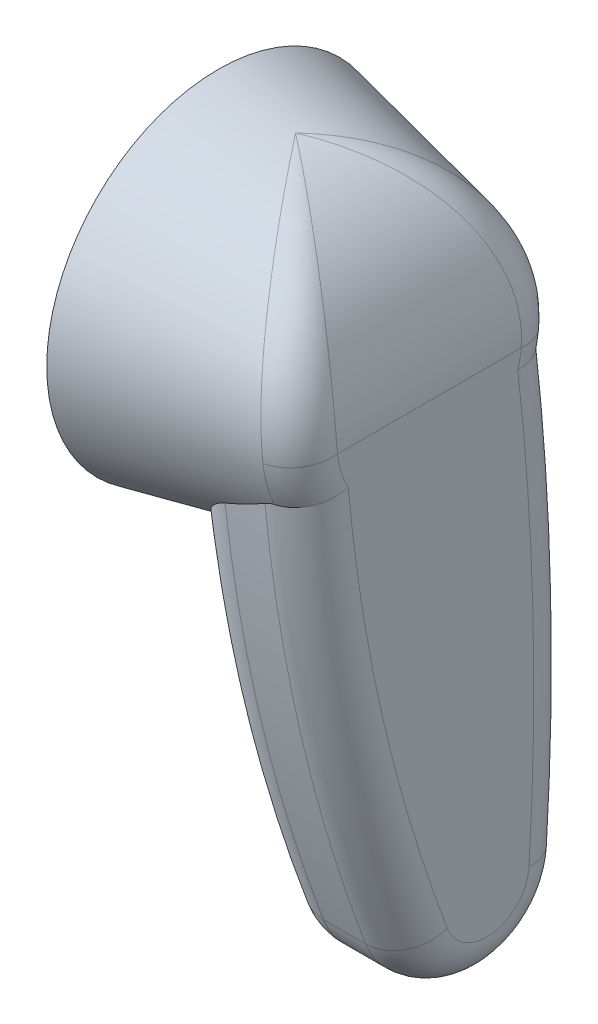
ISO-10303-21;
HEADER;
FILE_DESCRIPTION(('STEP AP214'),'2;1');
FILE_NAME('part.step','',(''),(''),'','','');
FILE_SCHEMA(('AUTOMOTIVE_DESIGN { 1 0 10303 214 1 1 1 1 }'));
ENDSEC;
DATA;
#1=APPLICATION_CONTEXT('core data for automotive mechanical design processes');
#2=APPLICATION_PROTOCOL_DEFINITION('international standard','automotive_design',2000,#1);
#3=PRODUCT_CONTEXT('',#1,'mechanical');
#4=PRODUCT('Part','Part','',(#3));
#5=PRODUCT_RELATED_PRODUCT_CATEGORY('part','',(#4));
#6=PRODUCT_DEFINITION_FORMATION('','',#4);
#7=PRODUCT_DEFINITION_CONTEXT('part definition',#1,'design');
#8=PRODUCT_DEFINITION('design','',#6,#7);
#9=PRODUCT_DEFINITION_SHAPE('','',#8);
#10=(LENGTH_UNIT() NAMED_UNIT(*) SI_UNIT(.MILLI.,.METRE.));
#11=(NAMED_UNIT(*) PLANE_ANGLE_UNIT() SI_UNIT($,.RADIAN.));
#12=(NAMED_UNIT(*) SI_UNIT($,.STERADIAN.) SOLID_ANGLE_UNIT());
#13=UNCERTAINTY_MEASURE_WITH_UNIT(LENGTH_MEASURE(1.E-05),#10,'distance_accuracy_value','');
#14=(GEOMETRIC_REPRESENTATION_CONTEXT(3) GLOBAL_UNCERTAINTY_ASSIGNED_CONTEXT((#13)) GLOBAL_UNIT_ASSIGNED_CONTEXT((#10,
#11,#12)) REPRESENTATION_CONTEXT('',''));
#15=CARTESIAN_POINT('',(0.,0.,0.));
#16=DIRECTION('',(0.,0.,1.));
#17=DIRECTION('',(1.,0.,0.));
#18=AXIS2_PLACEMENT_3D('',#15,#16,#17);
#19=CARTESIAN_POINT('',(292.1,256.100872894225,-943.602671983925));
#20=DIRECTION('',(-1.,0.,0.));
#21=DIRECTION('',(0.,0.,1.));
#22=AXIS2_PLACEMENT_3D('',#19,#20,#21);
#23=CYLINDRICAL_SURFACE('',#22,1016.);
#24=CARTESIAN_POINT('',(292.099999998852,187.624514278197,70.0871170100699));
#25=CARTESIAN_POINT('',(292.100022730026,187.317403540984,70.06637150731));
#26=CARTESIAN_POINT('',(292.091886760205,187.010361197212,70.0454897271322));
#27=CARTESIAN_POINT('',(292.059496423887,186.397188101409,70.0035092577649));
#28=CARTESIAN_POINT('',(292.035244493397,186.09105721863,69.9824106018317));
#29=CARTESIAN_POINT('',(291.938763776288,185.176517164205,69.9189647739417));
#30=CARTESIAN_POINT('',(291.842808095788,184.570482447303,69.8763678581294));
#31=CARTESIAN_POINT('',(291.594117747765,183.383048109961,69.7918541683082));
#32=CARTESIAN_POINT('',(291.442551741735,182.801398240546,69.7499407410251));
#33=CARTESIAN_POINT('',(291.087887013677,181.653801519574,69.6662779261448));
#34=CARTESIAN_POINT('',(290.884759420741,181.087863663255,69.624528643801));
#35=CARTESIAN_POINT('',(290.367967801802,179.813743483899,69.5294968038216));
#36=CARTESIAN_POINT('',(290.03932117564,179.111638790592,69.4763625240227));
#37=CARTESIAN_POINT('',(289.31977819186,177.740180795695,69.3712050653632));
#38=CARTESIAN_POINT('',(288.928861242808,177.070838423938,69.3191822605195));
#39=CARTESIAN_POINT('',(288.093038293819,175.75935267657,69.2160069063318));
#40=CARTESIAN_POINT('',(287.647724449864,175.117470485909,69.1648646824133));
#41=CARTESIAN_POINT('',(286.715462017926,173.864932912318,69.0639290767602));
#42=CARTESIAN_POINT('',(286.228517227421,173.254274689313,69.014135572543));
#43=CARTESIAN_POINT('',(285.110230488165,171.930813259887,68.9050730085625));
#44=CARTESIAN_POINT('',(284.470640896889,171.224978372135,68.8461207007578));
#45=CARTESIAN_POINT('',(283.151797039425,169.851005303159,68.7299984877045));
#46=CARTESIAN_POINT('',(282.472526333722,169.182882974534,68.6728293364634));
#47=CARTESIAN_POINT('',(281.081504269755,167.879132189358,68.5600388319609));
#48=CARTESIAN_POINT('',(280.36970364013,167.243556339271,68.5044200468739));
#49=CARTESIAN_POINT('',(278.920807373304,166.002129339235,68.394662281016));
#50=CARTESIAN_POINT('',(278.183715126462,165.396274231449,68.3405231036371));
#51=CARTESIAN_POINT('',(276.682067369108,164.205431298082,68.2330796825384));
#52=CARTESIAN_POINT('',(275.917325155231,163.620678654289,68.1797872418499));
#53=CARTESIAN_POINT('',(274.370314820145,162.474757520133,68.0743918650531));
#54=CARTESIAN_POINT('',(273.588046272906,161.913589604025,68.0222889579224));
#55=CARTESIAN_POINT('',(272.009595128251,160.812785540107,67.9191941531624));
#56=CARTESIAN_POINT('',(271.213426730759,160.273129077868,67.8682012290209));
#57=CARTESIAN_POINT('',(269.608670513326,159.212567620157,67.7671614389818));
#58=CARTESIAN_POINT('',(268.800082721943,158.691662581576,67.7171145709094));
#59=CARTESIAN_POINT('',(266.938254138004,157.519341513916,67.6035984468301));
#60=CARTESIAN_POINT('',(265.881512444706,156.873461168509,67.5404070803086));
#61=CARTESIAN_POINT('',(263.753353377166,155.606167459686,67.4152405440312));
#62=CARTESIAN_POINT('',(262.681935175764,154.984755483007,67.3532654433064));
#63=CARTESIAN_POINT('',(260.526537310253,153.763464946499,67.2303664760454));
#64=CARTESIAN_POINT('',(259.442554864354,153.163591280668,67.1694428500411));
#65=CARTESIAN_POINT('',(257.264103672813,151.983154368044,67.0485302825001));
#66=CARTESIAN_POINT('',(256.169635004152,151.402590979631,66.9885413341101));
#67=CARTESIAN_POINT('',(253.96980975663,150.257797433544,66.8692846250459));
#68=CARTESIAN_POINT('',(252.864437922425,149.693596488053,66.8100182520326));
#69=CARTESIAN_POINT('',(250.64580209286,148.580822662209,66.692211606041));
#70=CARTESIAN_POINT('',(249.532537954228,148.032250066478,66.6336713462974));
#71=CARTESIAN_POINT('',(247.299072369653,146.949247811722,66.517231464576));
#72=CARTESIAN_POINT('',(246.178870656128,146.414818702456,66.4593318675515));
#73=CARTESIAN_POINT('',(243.932378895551,145.358848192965,66.3441018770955));
#74=CARTESIAN_POINT('',(242.806088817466,144.837306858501,66.2867714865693));
#75=CARTESIAN_POINT('',(240.615748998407,143.836900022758,66.1760355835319));
#76=CARTESIAN_POINT('',(239.552013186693,143.357349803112,66.1226007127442));
#77=CARTESIAN_POINT('',(237.420289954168,142.407876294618,66.0161326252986));
#78=CARTESIAN_POINT('',(236.352302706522,141.937952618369,65.9630993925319));
#79=CARTESIAN_POINT('',(233.14240614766,140.541436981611,65.8045280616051));
#80=CARTESIAN_POINT('',(230.994673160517,139.628150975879,65.6995239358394));
#81=CARTESIAN_POINT('',(226.695017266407,137.835796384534,65.4910709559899));
#82=CARTESIAN_POINT('',(224.543145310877,136.956605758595,65.3876175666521));
#83=CARTESIAN_POINT('',(221.307449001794,135.657787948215,65.2331189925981));
#84=CARTESIAN_POINT('',(220.22762650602,135.228199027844,65.1817357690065));
#85=CARTESIAN_POINT('',(218.065514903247,134.375259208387,65.079170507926));
#86=CARTESIAN_POINT('',(216.983225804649,133.951908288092,65.0279884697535));
#87=CARTESIAN_POINT('',(215.8998,133.531474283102,64.9768947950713));
#88=B_SPLINE_CURVE_WITH_KNOTS('',3,(#24,#25,#26,#27,#28,#29,#30,#31,#32,#33,#34,#35,#36,#37,#38,
#39,#40,#41,#42,#43,#44,#45,#46,#47,#48,#49,#50,#51,#52,#53,#54,#55,#56,#57,#58,#59,#60,#61,#62,
#63,#64,#65,#66,#67,#68,#69,#70,#71,#72,#73,#74,#75,#76,#77,#78,#79,#80,#81,#82,#83,#84,#85,#86,
#87),.UNSPECIFIED.,.F.,.F.,(4,2,2,2,2,2,2,2,2,2,2,2,2,2,2,2,2,2,2,2,2,2,2,2,2,2,2,2,2,2,2,4),
(0.,0.923209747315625,1.84627997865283,3.68799790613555,5.49304254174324,7.29910011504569,
9.62631187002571,11.954294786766,14.3009479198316,16.6473872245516,19.5084097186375,
22.3706260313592,25.2373314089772,28.1036539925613,30.9956201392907,33.88765666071,
36.7768940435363,39.666124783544,43.3860356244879,47.1061569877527,50.8271183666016,
54.5480524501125,58.2752649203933,62.0025452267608,65.7299702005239,69.457414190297,
72.9615337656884,76.4655120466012,83.4738352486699,90.4541815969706,93.9439833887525,
97.4337733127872),.UNSPECIFIED.);
#89=CARTESIAN_POINT('',(266.7,157.37888368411,67.5896780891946));
#90=VERTEX_POINT('',#89);
#91=CARTESIAN_POINT('',(241.3,144.149686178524,66.2106433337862));
#92=VERTEX_POINT('',#91);
#93=EDGE_CURVE('E303',#90,#92,#88,.T.);
#94=ORIENTED_EDGE('',*,*,#93,.T.);
#95=CARTESIAN_POINT('',(241.3,256.100872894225,-943.602671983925));
#96=DIRECTION('',(1.,0.,0.));
#97=DIRECTION('',(0.,0.,-1.));
#98=AXIS2_PLACEMENT_3D('',#95,#96,#97);
#99=CIRCLE('',#98,1016.);
#100=CARTESIAN_POINT('',(241.3,-102.421094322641,7.03816399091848));
#101=VERTEX_POINT('',#100);
#102=EDGE_CURVE('E57',#92,#101,#99,.T.);
#103=ORIENTED_EDGE('',*,*,#102,.T.);
#104=DIRECTION('',(-1.,0.,0.));
#105=VECTOR('',#104,1.);
#106=CARTESIAN_POINT('',(292.1,-102.421094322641,7.03816399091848));
#107=LINE('',#106,#105);
#108=CARTESIAN_POINT('',(266.7,-102.421094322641,7.03816399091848));
#109=VERTEX_POINT('',#108);
#110=EDGE_CURVE('E317',#109,#101,#107,.T.);
#111=ORIENTED_EDGE('',*,*,#110,.F.);
#112=CARTESIAN_POINT('',(266.7,256.100872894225,-943.602671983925));
#113=DIRECTION('',(1.,0.,0.));
#114=DIRECTION('',(0.,0.,-1.));
#115=AXIS2_PLACEMENT_3D('',#112,#113,#114);
#116=CIRCLE('',#115,1016.);
#117=EDGE_CURVE('E151',#109,#90,#116,.F.);
#118=ORIENTED_EDGE('',*,*,#117,.T.);
#119=EDGE_LOOP('',(#94,#103,#111,#118));
#120=FACE_BOUND('',#119,.T.);
#121=ADVANCED_FACE('F34',(#120),#23,.T.);
#122=CARTESIAN_POINT('',(292.1,-84.4949959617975,-40.4938778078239));
#123=DIRECTION('',(-1.,0.,0.));
#124=DIRECTION('',(0.,0.,1.));
#125=AXIS2_PLACEMENT_3D('',#122,#123,#124);
#126=CYLINDRICAL_SURFACE('',#125,50.8000000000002);
#127=ORIENTED_EDGE('',*,*,#110,.T.);
#128=CARTESIAN_POINT('',(241.3,-84.4949959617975,-40.4938778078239));
#129=DIRECTION('',(1.,0.,0.));
#130=DIRECTION('',(0.,0.,-1.));
#131=AXIS2_PLACEMENT_3D('',#128,#129,#130);
#132=CIRCLE('',#131,50.8000000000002);
#133=CARTESIAN_POINT('',(241.3,-87.6442779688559,-91.1961659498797));
#134=VERTEX_POINT('',#133);
#135=EDGE_CURVE('E353',#101,#134,#132,.T.);
#136=ORIENTED_EDGE('',*,*,#135,.T.);
#137=DIRECTION('',(-1.,0.,0.));
#138=VECTOR('',#137,1.);
#139=CARTESIAN_POINT('',(292.1,-87.6442779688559,-91.1961659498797));
#140=LINE('',#139,#138);
#141=CARTESIAN_POINT('',(266.7,-87.6442779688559,-91.1961659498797));
#142=VERTEX_POINT('',#141);
#143=EDGE_CURVE('E309',#142,#134,#140,.T.);
#144=ORIENTED_EDGE('',*,*,#143,.F.);
#145=CARTESIAN_POINT('',(266.7,-84.4949959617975,-40.4938778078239));
#146=DIRECTION('',(1.,0.,0.));
#147=DIRECTION('',(0.,0.,-1.));
#148=AXIS2_PLACEMENT_3D('',#145,#146,#147);
#149=CIRCLE('',#148,50.8000000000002);
#150=EDGE_CURVE('E335',#142,#109,#149,.F.);
#151=ORIENTED_EDGE('',*,*,#150,.T.);
#152=EDGE_LOOP('',(#127,#136,#144,#151));
#153=FACE_BOUND('',#152,.T.);
#154=ADVANCED_FACE('F290',(#153),#126,.T.);
#155=CARTESIAN_POINT('',(292.1,6.83418224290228,1429.87247831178));
#156=DIRECTION('',(-1.,0.,0.));
#157=DIRECTION('',(0.,0.,1.));
#158=AXIS2_PLACEMENT_3D('',#155,#156,#157);
#159=CYLINDRICAL_SURFACE('',#158,1524.);
#160=ORIENTED_EDGE('',*,*,#143,.T.);
#161=CARTESIAN_POINT('',(241.3,6.83418224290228,1429.87247831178));
#162=DIRECTION('',(1.,0.,0.));
#163=DIRECTION('',(0.,0.,-1.));
#164=AXIS2_PLACEMENT_3D('',#161,#162,#163);
#165=CIRCLE('',#164,1524.);
#166=CARTESIAN_POINT('',(241.3,159.759376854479,-86.4354999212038));
#167=VERTEX_POINT('',#166);
#168=EDGE_CURVE('E207',#134,#167,#165,.T.);
#169=ORIENTED_EDGE('',*,*,#168,.T.);
#170=CARTESIAN_POINT('',(215.8998,149.262670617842,-87.4574547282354));
#171=CARTESIAN_POINT('',(217.071458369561,149.712553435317,-87.4152249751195));
#172=CARTESIAN_POINT('',(218.241814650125,150.165768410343,-87.3724811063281));
#173=CARTESIAN_POINT('',(220.579689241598,151.079370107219,-87.2858972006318));
#174=CARTESIAN_POINT('',(221.747207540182,151.53975686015,-87.2420571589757));
#175=CARTESIAN_POINT('',(225.245508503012,152.932576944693,-87.1087773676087));
#176=CARTESIAN_POINT('',(227.571666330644,153.876528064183,-87.0175912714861));
#177=CARTESIAN_POINT('',(231.055881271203,155.321771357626,-86.876568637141));
#178=CARTESIAN_POINT('',(232.219554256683,155.809749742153,-86.8287201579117));
#179=CARTESIAN_POINT('',(234.542681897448,156.795474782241,-86.7315755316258));
#180=CARTESIAN_POINT('',(235.702136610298,157.293221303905,-86.6822794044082));
#181=CARTESIAN_POINT('',(238.016267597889,158.299285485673,-86.5821296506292));
#182=CARTESIAN_POINT('',(239.170944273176,158.807602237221,-86.5312761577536));
#183=CARTESIAN_POINT('',(241.475120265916,159.835837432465,-86.4278746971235));
#184=CARTESIAN_POINT('',(242.624619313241,160.355756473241,-86.3753266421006));
#185=CARTESIAN_POINT('',(244.931216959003,161.414464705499,-86.2677601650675));
#186=CARTESIAN_POINT('',(246.088245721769,161.953403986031,-86.2127199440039));
#187=CARTESIAN_POINT('',(248.395440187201,163.045564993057,-86.1005772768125));
#188=CARTESIAN_POINT('',(249.545605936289,163.598786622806,-86.0434748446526));
#189=CARTESIAN_POINT('',(251.838031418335,164.721006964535,-85.9270034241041));
#190=CARTESIAN_POINT('',(252.980291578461,165.290004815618,-85.8676345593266));
#191=CARTESIAN_POINT('',(255.255735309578,166.44557223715,-85.7463859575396));
#192=CARTESIAN_POINT('',(256.388919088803,167.032141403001,-85.6845062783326));
#193=CARTESIAN_POINT('',(258.642418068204,168.223732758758,-85.5580780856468));
#194=CARTESIAN_POINT('',(259.762754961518,168.828714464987,-85.4935353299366));
#195=CARTESIAN_POINT('',(261.991084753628,170.060768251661,-85.3613206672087));
#196=CARTESIAN_POINT('',(263.099077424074,170.68784073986,-85.2936487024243));
#197=CARTESIAN_POINT('',(265.299916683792,171.966806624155,-85.1547920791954));
#198=CARTESIAN_POINT('',(266.392768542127,172.618691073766,-85.0836086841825));
#199=CARTESIAN_POINT('',(268.560588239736,173.951036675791,-84.9372148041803));
#200=CARTESIAN_POINT('',(269.635557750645,174.631495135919,-84.862004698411));
#201=CARTESIAN_POINT('',(271.154709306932,175.626613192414,-84.751305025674));
#202=CARTESIAN_POINT('',(271.607879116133,175.927798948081,-84.7177113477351));
#203=CARTESIAN_POINT('',(272.50978932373,176.536626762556,-84.6496159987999));
#204=CARTESIAN_POINT('',(272.958529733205,176.84426880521,-84.6151143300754));
#205=CARTESIAN_POINT('',(274.297581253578,177.777606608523,-84.5101477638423));
#206=CARTESIAN_POINT('',(275.180620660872,178.413647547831,-84.4382286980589));
#207=CARTESIAN_POINT('',(276.92540854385,179.719214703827,-84.2897318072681));
#208=CARTESIAN_POINT('',(277.787085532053,180.388835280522,-84.2131407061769));
#209=CARTESIAN_POINT('',(279.480307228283,181.764627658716,-84.0548049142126));
#210=CARTESIAN_POINT('',(280.311854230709,182.470796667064,-83.9730606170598));
#211=CARTESIAN_POINT('',(281.946951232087,183.934793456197,-83.8024946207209));
#212=CARTESIAN_POINT('',(282.750011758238,184.693163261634,-83.713596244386));
#213=CARTESIAN_POINT('',(284.305140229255,186.260731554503,-83.5285712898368));
#214=CARTESIAN_POINT('',(285.057184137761,187.069953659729,-83.4324413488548));
#215=CARTESIAN_POINT('',(286.489716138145,188.743052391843,-83.2322336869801));
#216=CARTESIAN_POINT('',(287.170519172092,189.60665885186,-83.1281947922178));
#217=CARTESIAN_POINT('',(288.122155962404,190.94961065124,-82.9651572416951));
#218=CARTESIAN_POINT('',(288.427631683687,191.404933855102,-82.90967909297));
#219=CARTESIAN_POINT('',(289.011839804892,192.332312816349,-82.7962434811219));
#220=CARTESIAN_POINT('',(289.290569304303,192.804370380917,-82.7382857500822));
#221=CARTESIAN_POINT('',(289.817919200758,193.767136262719,-82.6196065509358));
#222=CARTESIAN_POINT('',(290.066420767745,194.257908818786,-82.5588753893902));
#223=CARTESIAN_POINT('',(290.527134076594,195.255750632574,-82.4348863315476));
#224=CARTESIAN_POINT('',(290.739361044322,195.762812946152,-82.3716295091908));
#225=CARTESIAN_POINT('',(291.122066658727,196.79077293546,-82.2428483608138));
#226=CARTESIAN_POINT('',(291.292652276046,197.311631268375,-82.177330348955));
#227=CARTESIAN_POINT('',(291.587822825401,198.365770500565,-82.0441638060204));
#228=CARTESIAN_POINT('',(291.712430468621,198.899045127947,-81.9765163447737));
#229=CARTESIAN_POINT('',(291.906812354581,199.948844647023,-81.8427704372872));
#230=CARTESIAN_POINT('',(291.978940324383,200.464937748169,-81.7767545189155));
#231=CARTESIAN_POINT('',(292.051411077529,201.242805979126,-81.676844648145));
#232=CARTESIAN_POINT('',(292.069614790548,201.503065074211,-81.6433485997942));
#233=CARTESIAN_POINT('',(292.093917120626,202.024149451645,-81.5761466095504));
#234=CARTESIAN_POINT('',(292.100014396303,202.284974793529,-81.5424406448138));
#235=CARTESIAN_POINT('',(292.099999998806,202.545828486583,-81.5086620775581));
#236=B_SPLINE_CURVE_WITH_KNOTS('',3,(#170,#171,#172,#173,#174,#175,#176,#177,#178,#179,#180,
#181,#182,#183,#184,#185,#186,#187,#188,#189,#190,#191,#192,#193,#194,#195,#196,#197,#198,#199,
#200,#201,#202,#203,#204,#205,#206,#207,#208,#209,#210,#211,#212,#213,#214,#215,#216,#217,#218,
#219,#220,#221,#222,#223,#224,#225,#226,#227,#228,#229,#230,#231,#232,#233,#234,#235),
.UNSPECIFIED.,.F.,.F.,(4,2,2,2,2,2,2,2,2,2,2,2,2,2,2,2,2,2,2,2,2,2,2,2,2,2,2,2,2,2,2,2,4),(0.,
3.76729869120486,7.53461371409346,15.0704358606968,18.8586619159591,22.6468360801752,
26.4346859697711,30.2227312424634,34.0553693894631,37.8879815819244,41.7203850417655,
45.5527003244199,49.3771244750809,53.2016192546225,57.0247478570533,60.8475170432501,
62.4829614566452,64.1184017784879,67.389648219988,70.6706674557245,73.9514363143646,
77.2738569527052,80.5978322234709,83.9064298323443,85.5589972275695,87.2117436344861,
88.8707905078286,90.5291392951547,92.1831821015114,93.8364067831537,95.4099363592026,
96.1988000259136,96.9877510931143),.UNSPECIFIED.);
#237=CARTESIAN_POINT('',(266.699999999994,172.810855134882,-85.0624193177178));
#238=VERTEX_POINT('',#237);
#239=EDGE_CURVE('E310',#167,#238,#236,.T.);
#240=ORIENTED_EDGE('',*,*,#239,.T.);
#241=CARTESIAN_POINT('',(266.7,6.83418224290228,1429.87247831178));
#242=DIRECTION('',(1.,0.,0.));
#243=DIRECTION('',(0.,0.,-1.));
#244=AXIS2_PLACEMENT_3D('',#241,#242,#243);
#245=CIRCLE('',#244,1524.);
#246=EDGE_CURVE('E333',#238,#142,#245,.F.);
#247=ORIENTED_EDGE('',*,*,#246,.T.);
#248=EDGE_LOOP('',(#160,#169,#240,#247));
#249=FACE_BOUND('',#248,.T.);
#250=ADVANCED_FACE('F296',(#249),#159,.T.);
#251=CARTESIAN_POINT('',(292.1,85.8029384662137,-492.048274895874));
#252=DIRECTION('',(1.,0.,0.));
#253=DIRECTION('',(0.,0.,-1.));
#254=AXIS2_PLACEMENT_3D('',#251,#252,#253);
#255=PLANE('',#254);
#256=DIRECTION('',(0.,0.,-1.));
#257=VECTOR('',#256,1.);
#258=CARTESIAN_POINT('',(292.1,186.685998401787,705.950796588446));
#259=LINE('',#258,#257);
#260=CARTESIAN_POINT('',(292.1,186.685998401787,49.3592673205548));
#261=VERTEX_POINT('',#260);
#262=CARTESIAN_POINT('',(292.1,186.685998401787,-61.2385266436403));
#263=VERTEX_POINT('',#262);
#264=EDGE_CURVE('E130',#261,#263,#259,.T.);
#265=ORIENTED_EDGE('',*,*,#264,.F.);
#266=CARTESIAN_POINT('',(292.1,192.760056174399,-5.93962966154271));
#267=DIRECTION('',(1.,0.,0.));
#268=DIRECTION('',(0.,0.,-1.));
#269=AXIS2_PLACEMENT_3D('',#266,#267,#268);
#270=CIRCLE('',#269,55.631485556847);
#271=CARTESIAN_POINT('',(292.1,166.127929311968,42.9028928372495));
#272=VERTEX_POINT('',#271);
#273=EDGE_CURVE('E331',#261,#272,#270,.T.);
#274=ORIENTED_EDGE('',*,*,#273,.T.);
#275=CARTESIAN_POINT('',(292.1,256.100872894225,-943.602671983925));
#276=DIRECTION('',(1.,0.,0.));
#277=DIRECTION('',(0.,0.,-1.));
#278=AXIS2_PLACEMENT_3D('',#275,#276,#277);
#279=CIRCLE('',#278,990.6);
#280=CARTESIAN_POINT('',(292.1,-93.4580451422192,-16.7278569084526));
#281=VERTEX_POINT('',#280);
#282=EDGE_CURVE('E329',#272,#281,#279,.T.);
#283=ORIENTED_EDGE('',*,*,#282,.T.);
#284=CARTESIAN_POINT('',(292.1,-84.4949959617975,-40.4938778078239));
#285=DIRECTION('',(1.,0.,0.));
#286=DIRECTION('',(0.,0.,-1.));
#287=AXIS2_PLACEMENT_3D('',#284,#285,#286);
#288=CIRCLE('',#287,25.4000000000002);
#289=CARTESIAN_POINT('',(292.1,-86.0696369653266,-65.8450218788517));
#290=VERTEX_POINT('',#289);
#291=EDGE_CURVE('E327',#281,#290,#288,.T.);
#292=ORIENTED_EDGE('',*,*,#291,.T.);
#293=CARTESIAN_POINT('',(292.1,6.83418224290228,1429.87247831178));
#294=DIRECTION('',(1.,0.,0.));
#295=DIRECTION('',(0.,0.,-1.));
#296=AXIS2_PLACEMENT_3D('',#293,#294,#295);
#297=CIRCLE('',#296,1498.6);
#298=CARTESIAN_POINT('',(292.1,176.381801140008,-59.1055487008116));
#299=VERTEX_POINT('',#298);
#300=EDGE_CURVE('E324',#290,#299,#297,.T.);
#301=ORIENTED_EDGE('',*,*,#300,.T.);
#302=CARTESIAN_POINT('',(292.1,192.760056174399,-5.93962966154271));
#303=DIRECTION('',(1.,0.,0.));
#304=DIRECTION('',(0.,0.,-1.));
#305=AXIS2_PLACEMENT_3D('',#302,#303,#304);
#306=CIRCLE('',#305,55.631485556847);
#307=EDGE_CURVE('E322',#299,#263,#306,.T.);
#308=ORIENTED_EDGE('',*,*,#307,.T.);
#309=EDGE_LOOP('',(#265,#274,#283,#292,#301,#308));
#310=FACE_BOUND('',#309,.T.);
#311=ADVANCED_FACE('F377',(#310),#255,.T.);
#312=CARTESIAN_POINT('',(215.9,85.8029384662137,-492.048274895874));
#313=DIRECTION('',(1.,0.,0.));
#314=DIRECTION('',(0.,0.,-1.));
#315=AXIS2_PLACEMENT_3D('',#312,#313,#314);
#316=PLANE('',#315);
#317=CARTESIAN_POINT('',(215.9,192.760056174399,-5.93962966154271));
#318=DIRECTION('',(1.,0.,0.));
#319=DIRECTION('',(0.,0.,-1.));
#320=AXIS2_PLACEMENT_3D('',#317,#318,#319);
#321=CIRCLE('',#320,92.3968099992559);
#322=CARTESIAN_POINT('',(215.9,110.556223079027,36.246864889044));
#323=VERTEX_POINT('',#322);
#324=CARTESIAN_POINT('',(215.9,121.175586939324,-64.3590978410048));
#325=VERTEX_POINT('',#324);
#326=EDGE_CURVE('E319',#323,#325,#321,.T.);
#327=ORIENTED_EDGE('',*,*,#326,.T.);
#328=CARTESIAN_POINT('',(215.9,6.83418224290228,1429.87247831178));
#329=DIRECTION('',(1.,0.,0.));
#330=DIRECTION('',(0.,0.,-1.));
#331=AXIS2_PLACEMENT_3D('',#328,#329,#330);
#332=CIRCLE('',#331,1498.6);
#333=CARTESIAN_POINT('',(215.9,-86.0696369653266,-65.8450218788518));
#334=VERTEX_POINT('',#333);
#335=EDGE_CURVE('E518',#325,#334,#332,.F.);
#336=ORIENTED_EDGE('',*,*,#335,.T.);
#337=CARTESIAN_POINT('',(215.9,-84.4949959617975,-40.4938778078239));
#338=DIRECTION('',(1.,0.,0.));
#339=DIRECTION('',(0.,0.,-1.));
#340=AXIS2_PLACEMENT_3D('',#337,#338,#339);
#341=CIRCLE('',#340,25.4000000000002);
#342=CARTESIAN_POINT('',(215.9,-93.4580451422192,-16.7278569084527));
#343=VERTEX_POINT('',#342);
#344=EDGE_CURVE('E519',#334,#343,#341,.F.);
#345=ORIENTED_EDGE('',*,*,#344,.T.);
#346=CARTESIAN_POINT('',(215.9,256.100872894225,-943.602671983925));
#347=DIRECTION('',(1.,0.,0.));
#348=DIRECTION('',(0.,0.,-1.));
#349=AXIS2_PLACEMENT_3D('',#346,#347,#348);
#350=CIRCLE('',#349,990.6);
#351=EDGE_CURVE('E517',#343,#323,#350,.F.);
#352=ORIENTED_EDGE('',*,*,#351,.T.);
#353=EDGE_LOOP('',(#327,#336,#345,#352));
#354=FACE_BOUND('',#353,.T.);
#355=ADVANCED_FACE('F374',(#354),#316,.F.);
#356=CARTESIAN_POINT('',(292.1,192.760056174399,-5.93962966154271));
#357=DIRECTION('',(-1.,0.,0.));
#358=DIRECTION('',(0.,0.,-1.));
#359=AXIS2_PLACEMENT_3D('',#356,#357,#358);
#360=CONICAL_SURFACE('',#359,76.2000000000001,0.20943951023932);
#361=CARTESIAN_POINT('',(266.7,157.37888368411,67.5896780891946));
#362=CARTESIAN_POINT('',(266.947537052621,157.531087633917,67.6045310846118));
#363=CARTESIAN_POINT('',(267.199172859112,157.677398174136,67.6151506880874));
#364=CARTESIAN_POINT('',(267.711123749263,157.955785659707,67.6269189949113));
#365=CARTESIAN_POINT('',(267.971457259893,158.087829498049,67.6280461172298));
#366=CARTESIAN_POINT('',(268.493529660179,158.331426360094,67.6198525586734));
#367=CARTESIAN_POINT('',(268.75506957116,158.443410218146,67.6107931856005));
#368=CARTESIAN_POINT('',(269.285037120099,158.647867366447,67.5816780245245));
#369=CARTESIAN_POINT('',(269.553461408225,158.740349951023,67.5616274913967));
#370=CARTESIAN_POINT('',(269.999803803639,158.874129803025,67.5189157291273));
#371=CARTESIAN_POINT('',(270.176113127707,158.921955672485,67.4996930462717));
#372=CARTESIAN_POINT('',(270.53053937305,159.007566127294,67.4561669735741));
#373=CARTESIAN_POINT('',(270.708656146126,159.045351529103,67.4318639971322));
#374=CARTESIAN_POINT('',(271.068908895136,159.110785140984,67.3776511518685));
#375=CARTESIAN_POINT('',(271.251063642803,159.13826190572,67.3476579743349));
#376=CARTESIAN_POINT('',(271.615864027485,159.181826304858,67.2823297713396));
#377=CARTESIAN_POINT('',(271.798509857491,159.197908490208,67.2469921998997));
#378=CARTESIAN_POINT('',(271.980956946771,159.20808449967,67.2089979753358));
#379=B_SPLINE_CURVE_WITH_KNOTS('',3,(#361,#362,#363,#364,#365,#366,#367,#368,#369,#370,#371,
#372,#373,#374,#375,#376,#377,#378),.UNSPECIFIED.,.F.,.F.,(4,2,2,2,2,2,2,2,4),(0.,
0.873065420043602,1.74811520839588,2.60121993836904,3.45391715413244,4.00467294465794,
4.55538393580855,5.11488577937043,5.6746550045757),.UNSPECIFIED.);
#380=CARTESIAN_POINT('',(271.980956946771,159.20808449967,67.2089979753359));
#381=VERTEX_POINT('',#380);
#382=EDGE_CURVE('E159',#90,#381,#379,.T.);
#383=ORIENTED_EDGE('',*,*,#382,.T.);
#384=CARTESIAN_POINT('',(271.980956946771,192.760056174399,-5.93962966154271));
#385=DIRECTION('',(1.,0.,0.));
#386=DIRECTION('',(0.,0.,-1.));
#387=AXIS2_PLACEMENT_3D('',#384,#385,#386);
#388=CIRCLE('',#387,80.4764346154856);
#389=CARTESIAN_POINT('',(271.980956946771,183.973332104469,74.0556827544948));
#390=VERTEX_POINT('',#389);
#391=EDGE_CURVE('E135',#381,#390,#388,.F.);
#392=ORIENTED_EDGE('',*,*,#391,.T.);
#393=CARTESIAN_POINT('',(289.552525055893,164.077210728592,45.1465872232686));
#394=CARTESIAN_POINT('',(288.040530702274,157.452934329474,62.6751985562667));
#395=CARTESIAN_POINT('',(270.070350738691,159.518490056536,67.796281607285));
#396=CARTESIAN_POINT('',(289.752865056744,164.954866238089,45.4083143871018));
#397=CARTESIAN_POINT('',(288.33037448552,158.451582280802,63.1132041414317));
#398=CARTESIAN_POINT('',(270.2206057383,160.462747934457,68.18695832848));
#399=CARTESIAN_POINT('',(289.942694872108,165.840371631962,45.6598053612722));
#400=CARTESIAN_POINT('',(288.607605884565,159.4644000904,63.5354594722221));
#401=CARTESIAN_POINT('',(270.362978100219,161.416304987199,68.5624021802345));
#402=CARTESIAN_POINT('',(290.300316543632,167.625956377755,46.1417632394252));
#403=CARTESIAN_POINT('',(289.136022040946,161.521714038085,64.3485308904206));
#404=CARTESIAN_POINT('',(270.631194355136,163.340682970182,69.2818471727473));
#405=CARTESIAN_POINT('',(290.468106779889,168.526036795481,46.37222859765));
#406=CARTESIAN_POINT('',(289.387010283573,162.565991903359,64.7390800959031));
#407=CARTESIAN_POINT('',(270.757037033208,164.311505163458,69.6258460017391));
#408=CARTESIAN_POINT('',(290.780665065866,170.339882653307,46.8116336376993));
#409=CARTESIAN_POINT('',(289.860502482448,164.684881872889,65.4864317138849));
#410=CARTESIAN_POINT('',(270.991455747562,166.269335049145,70.2814986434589));
#411=CARTESIAN_POINT('',(290.925423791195,171.253653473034,47.0205645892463));
#412=CARTESIAN_POINT('',(290.082799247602,165.759214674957,65.8429531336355));
#413=CARTESIAN_POINT('',(271.100024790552,167.25634911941,70.5931393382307));
#414=CARTESIAN_POINT('',(291.190892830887,173.093058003,47.4162541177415));
#415=CARTESIAN_POINT('',(290.496364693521,167.935419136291,66.5196758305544));
#416=CARTESIAN_POINT('',(271.299126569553,169.244447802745,71.1829700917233));
#417=CARTESIAN_POINT('',(291.311603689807,174.018691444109,47.6030131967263));
#418=CARTESIAN_POINT('',(290.687445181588,169.036929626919,66.8396168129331));
#419=CARTESIAN_POINT('',(271.389659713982,170.245532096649,71.4611609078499));
#420=CARTESIAN_POINT('',(291.636095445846,176.809185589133,48.1288973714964));
#421=CARTESIAN_POINT('',(291.211027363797,172.381054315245,67.742144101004));
#422=CARTESIAN_POINT('',(271.633028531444,173.26510641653,72.2436667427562));
#423=CARTESIAN_POINT('',(291.802664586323,178.690109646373,48.4342284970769));
#424=CARTESIAN_POINT('',(291.491986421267,174.653916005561,68.2644011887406));
#425=CARTESIAN_POINT('',(271.757955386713,175.302584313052,72.6968098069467));
#426=CARTESIAN_POINT('',(292.030678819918,182.480460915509,48.9513456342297));
#427=CARTESIAN_POINT('',(291.90585619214,179.272592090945,69.1400644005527));
#428=CARTESIAN_POINT('',(271.928966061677,179.411148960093,73.4606746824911));
#429=CARTESIAN_POINT('',(292.092142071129,184.389883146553,49.1631477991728));
#430=CARTESIAN_POINT('',(292.037792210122,181.613980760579,69.4919482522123));
#431=CARTESIAN_POINT('',(271.975063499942,181.482229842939,73.7714210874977));
#432=CARTESIAN_POINT('',(292.106462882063,188.229139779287,49.4921204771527));
#433=CARTESIAN_POINT('',(292.143617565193,186.343106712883,70.0174591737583));
#434=CARTESIAN_POINT('',(271.985804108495,185.647507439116,74.2483247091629));
#435=CARTESIAN_POINT('',(292.059013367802,190.159016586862,49.6090221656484));
#436=CARTESIAN_POINT('',(292.1166549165,188.725841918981,70.1896771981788));
#437=CARTESIAN_POINT('',(271.950216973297,187.741752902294,74.4140712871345));
#438=CARTESIAN_POINT('',(291.853452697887,194.019048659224,49.7470571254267));
#439=CARTESIAN_POINT('',(291.900129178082,193.493240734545,70.3507065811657));
#440=CARTESIAN_POINT('',(271.796046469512,191.929688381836,74.5991078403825));
#441=CARTESIAN_POINT('',(291.695334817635,195.949203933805,49.7681845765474));
#442=CARTESIAN_POINT('',(291.710860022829,195.872603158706,70.3393989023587));
#443=CARTESIAN_POINT('',(271.677458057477,194.023378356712,74.6183889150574));
#444=CARTESIAN_POINT('',(291.26949305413,199.793494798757,49.7162331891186));
#445=CARTESIAN_POINT('',(291.173872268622,200.593369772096,70.1378864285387));
#446=CARTESIAN_POINT('',(271.358076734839,198.190704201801,74.5130391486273));
#447=CARTESIAN_POINT('',(291.001856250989,201.707641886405,49.6432290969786));
#448=CARTESIAN_POINT('',(290.827261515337,202.929833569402,69.9484979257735));
#449=CARTESIAN_POINT('',(271.157349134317,200.264354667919,74.3885225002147));
#450=CARTESIAN_POINT('',(290.35998439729,205.507711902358,49.4062561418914));
#451=CARTESIAN_POINT('',(289.986219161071,207.532827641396,69.4025829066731));
#452=CARTESIAN_POINT('',(270.675945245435,204.376689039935,74.0009541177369));
#453=CARTESIAN_POINT('',(289.985750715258,207.393635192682,49.2422884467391));
#454=CARTESIAN_POINT('',(289.493293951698,209.795159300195,69.0473618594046));
#455=CARTESIAN_POINT('',(270.395269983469,206.415373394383,73.7379041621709));
#456=CARTESIAN_POINT('',(289.144212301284,211.086667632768,48.8320901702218));
#457=CARTESIAN_POINT('',(288.386557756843,214.177554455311,68.1954866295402));
#458=CARTESIAN_POINT('',(269.764116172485,210.401665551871,73.0874820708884));
#459=CARTESIAN_POINT('',(288.678978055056,212.894599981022,48.5876192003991));
#460=CARTESIAN_POINT('',(287.77721714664,216.296296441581,67.7035497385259));
#461=CARTESIAN_POINT('',(269.415190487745,212.350284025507,72.7027756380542));
#462=CARTESIAN_POINT('',(287.656572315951,216.46188361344,48.0207594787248));
#463=CARTESIAN_POINT('',(286.448752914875,220.422690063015,66.5943108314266));
#464=CARTESIAN_POINT('',(268.648386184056,216.188201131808,71.8161764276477));
#465=CARTESIAN_POINT('',(287.099404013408,218.221236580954,47.6983734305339));
#466=CARTESIAN_POINT('',(285.731375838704,222.428393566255,65.9787263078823));
#467=CARTESIAN_POINT('',(268.230509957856,218.077501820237,71.3142877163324));
#468=CARTESIAN_POINT('',(285.899205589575,221.684765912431,46.9810762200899));
#469=CARTESIAN_POINT('',(284.203968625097,226.319620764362,64.6411532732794));
#470=CARTESIAN_POINT('',(267.33036113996,221.788846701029,70.2024355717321));
#471=CARTESIAN_POINT('',(285.256114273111,223.38890186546,46.5861132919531));
#472=CARTESIAN_POINT('',(283.395486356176,228.204069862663,63.9207237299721));
#473=CARTESIAN_POINT('',(266.848042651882,223.610841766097,69.5923950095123));
#474=CARTESIAN_POINT('',(283.891098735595,226.735073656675,45.7296193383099));
#475=CARTESIAN_POINT('',(281.702867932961,231.847578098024,62.3921772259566));
#476=CARTESIAN_POINT('',(265.824280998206,227.179593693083,68.2742608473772));
#477=CARTESIAN_POINT('',(283.169158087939,228.377096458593,45.2680744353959));
#478=CARTESIAN_POINT('',(280.82008780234,233.606409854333,61.5854656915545));
#479=CARTESIAN_POINT('',(265.282825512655,228.926334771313,67.566146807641));
#480=CARTESIAN_POINT('',(281.871790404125,231.131017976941,44.4260651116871));
#481=CARTESIAN_POINT('',(279.254724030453,236.514694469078,60.1416361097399));
#482=CARTESIAN_POINT('',(264.309799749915,231.847785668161,66.2785378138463));
#483=CARTESIAN_POINT('',(281.314007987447,232.259458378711,44.060504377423));
#484=CARTESIAN_POINT('',(278.589746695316,237.690978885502,59.5245340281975));
#485=CARTESIAN_POINT('',(263.891462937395,233.042423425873,65.7206927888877));
#486=CARTESIAN_POINT('',(280.164658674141,234.481113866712,43.3008411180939));
#487=CARTESIAN_POINT('',(277.23412214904,239.981361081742,58.2599663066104));
#488=CARTESIAN_POINT('',(263.02945095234,235.389420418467,64.564003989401));
#489=CARTESIAN_POINT('',(279.57309833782,235.574335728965,42.9067441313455));
#490=CARTESIAN_POINT('',(276.543783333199,241.095727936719,57.6128363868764));
#491=CARTESIAN_POINT('',(262.585780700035,236.541787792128,63.965168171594));
#492=CARTESIAN_POINT('',(277.750693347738,238.80105389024,41.6842513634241));
#493=CARTESIAN_POINT('',(274.447411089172,244.337857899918,55.63943931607));
#494=CARTESIAN_POINT('',(261.218976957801,239.935388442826,62.111594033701));
#495=CARTESIAN_POINT('',(276.47231574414,240.881200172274,40.8157780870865));
#496=CARTESIAN_POINT('',(273.002080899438,246.390246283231,54.2682759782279));
#497=CARTESIAN_POINT('',(260.260193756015,242.112693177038,60.7999793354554));
#498=CARTESIAN_POINT('',(273.805317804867,244.897748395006,38.9860718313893));
#499=CARTESIAN_POINT('',(270.048287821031,250.276593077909,51.4497721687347));
#500=CARTESIAN_POINT('',(258.259945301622,246.296107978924,58.0487055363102));
#501=CARTESIAN_POINT('',(272.416526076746,246.833917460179,38.0246941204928));
#502=CARTESIAN_POINT('',(268.540320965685,252.113766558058,50.003109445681));
#503=CARTESIAN_POINT('',(257.218351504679,248.301941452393,56.6088469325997));
#504=CARTESIAN_POINT('',(269.546125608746,250.559306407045,36.0235419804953));
#505=CARTESIAN_POINT('',(265.48219984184,255.588107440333,47.0572387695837));
#506=CARTESIAN_POINT('',(255.065551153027,252.140531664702,53.624651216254));
#507=CARTESIAN_POINT('',(268.064515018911,252.348523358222,34.9837659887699));
#508=CARTESIAN_POINT('',(263.931783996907,257.228970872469,45.55794206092));
#509=CARTESIAN_POINT('',(253.954343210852,253.973284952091,52.080312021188));
#510=CARTESIAN_POINT('',(264.422872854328,256.458432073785,32.414535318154));
#511=CARTESIAN_POINT('',(260.194638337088,260.933468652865,41.9331312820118));
#512=CARTESIAN_POINT('',(251.22311158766,258.158490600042,48.280739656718));
#513=CARTESIAN_POINT('',(262.225417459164,258.710999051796,30.8534734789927));
#514=CARTESIAN_POINT('',(257.98235341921,262.930535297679,39.778840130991));
#515=CARTESIAN_POINT('',(249.575020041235,260.431431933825,45.9850217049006));
#516=CARTESIAN_POINT('',(257.707431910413,262.944184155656,27.627272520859));
#517=CARTESIAN_POINT('',(253.524164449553,266.623455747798,35.4250438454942));
#518=CARTESIAN_POINT('',(246.186530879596,264.664547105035,41.2689210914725));
#519=CARTESIAN_POINT('',(255.386849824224,264.924686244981,25.9620894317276));
#520=CARTESIAN_POINT('',(251.274157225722,268.327684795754,33.2217188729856));
#521=CARTESIAN_POINT('',(244.446094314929,266.624587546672,38.8484858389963));
#522=CARTESIAN_POINT('',(250.646040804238,268.625387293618,22.5475127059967));
#523=CARTESIAN_POINT('',(246.752292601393,271.474648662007,28.7846135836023));
#524=CARTESIAN_POINT('',(240.89048754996,270.249902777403,33.9143917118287));
#525=CARTESIAN_POINT('',(248.225728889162,270.345358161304,20.7980470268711));
#526=CARTESIAN_POINT('',(244.475472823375,272.924225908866,26.5460743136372));
#527=CARTESIAN_POINT('',(239.075253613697,271.914919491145,31.4006535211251));
#528=CARTESIAN_POINT('',(243.308031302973,273.533318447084,17.2335852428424));
#529=CARTESIAN_POINT('',(239.909919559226,275.590067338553,22.050524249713));
#530=CARTESIAN_POINT('',(235.386980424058,274.964725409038,26.3084939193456));
#531=CARTESIAN_POINT('',(240.81066093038,275.0013575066,15.418602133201));
#532=CARTESIAN_POINT('',(237.615864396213,276.812026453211,19.7883459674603));
#533=CARTESIAN_POINT('',(233.513952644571,276.349569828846,23.7300853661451));
#534=CARTESIAN_POINT('',(236.130765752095,277.495355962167,12.0103941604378));
#535=CARTESIAN_POINT('',(233.359040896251,278.881118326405,15.5859104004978));
#536=CARTESIAN_POINT('',(230.00403126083,278.668803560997,18.9153980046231));
#537=CARTESIAN_POINT('',(233.956602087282,278.554591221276,10.4242946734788));
#538=CARTESIAN_POINT('',(231.396207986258,279.758863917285,13.6463235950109));
#539=CARTESIAN_POINT('',(228.373408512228,279.639550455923,16.6852153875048));
#540=CARTESIAN_POINT('',(229.572472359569,280.50313974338,7.22152722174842));
#541=CARTESIAN_POINT('',(227.465897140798,281.373466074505,9.75957886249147));
#542=CARTESIAN_POINT('',(225.085311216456,281.398198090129,12.2027372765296));
#543=CARTESIAN_POINT('',(227.362505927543,281.392451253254,5.60485894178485));
#544=CARTESIAN_POINT('',(225.495036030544,282.112437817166,7.80909038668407));
#545=CARTESIAN_POINT('',(223.427836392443,282.186096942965,9.95044155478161));
#546=CARTESIAN_POINT('',(222.918259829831,283.004191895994,2.35017805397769));
#547=CARTESIAN_POINT('',(221.553437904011,283.456635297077,3.90584569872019));
#548=CARTESIAN_POINT('',(220.094651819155,283.585355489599,5.4365317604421));
#549=CARTESIAN_POINT('',(220.684029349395,283.726909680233,0.712207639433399));
#550=CARTESIAN_POINT('',(219.579379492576,284.06367311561,1.9498125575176));
#551=CARTESIAN_POINT('',(218.41897895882,284.197021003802,3.17494082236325));
#552=CARTESIAN_POINT('',(216.1942859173,285.011035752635,-2.58213723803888));
#553=CARTESIAN_POINT('',(215.629044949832,285.151926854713,-1.96635886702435));
#554=CARTESIAN_POINT('',(215.051671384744,285.252057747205,-1.35383005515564));
#555=CARTESIAN_POINT('',(213.938778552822,285.572485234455,-4.23850688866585));
#556=CARTESIAN_POINT('',(213.649488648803,285.634288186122,-3.92974530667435));
#557=CARTESIAN_POINT('',(213.360040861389,285.695471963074,-3.62100841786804));
#558=CARTESIAN_POINT('',(211.65848323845,286.058423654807,-5.91416319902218));
#559=CARTESIAN_POINT('',(211.654151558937,286.059345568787,-5.90954193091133));
#560=CARTESIAN_POINT('',(211.649819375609,286.060265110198,-5.90492066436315));
#561=CARTESIAN_POINT('',(211.641155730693,286.062111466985,-5.92689623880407));
#562=CARTESIAN_POINT('',(211.638989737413,286.062571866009,-5.92458571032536));
#563=CARTESIAN_POINT('',(211.636823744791,286.063032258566,-5.92227518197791));
#564=CARTESIAN_POINT('',(211.623827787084,286.065794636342,-5.93962966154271));
#565=CARTESIAN_POINT('',(211.623827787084,286.065794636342,-5.93962966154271));
#566=CARTESIAN_POINT('',(211.623827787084,286.065794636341,-5.93962966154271));
#567=(BOUNDED_SURFACE() B_SPLINE_SURFACE(3,2,((#393,#394,#395),(#396,#397,#398),(#399,#400,
#401),(#402,#403,#404),(#405,#406,#407),(#408,#409,#410),(#411,#412,#413),(#414,#415,#416),
(#417,#418,#419),(#420,#421,#422),(#423,#424,#425),(#426,#427,#428),(#429,#430,#431),(#432,#433,
#434),(#435,#436,#437),(#438,#439,#440),(#441,#442,#443),(#444,#445,#446),(#447,#448,#449),
(#450,#451,#452),(#453,#454,#455),(#456,#457,#458),(#459,#460,#461),(#462,#463,#464),(#465,#466,
#467),(#468,#469,#470),(#471,#472,#473),(#474,#475,#476),(#477,#478,#479),(#480,#481,#482),
(#483,#484,#485),(#486,#487,#488),(#489,#490,#491),(#492,#493,#494),(#495,#496,#497),(#498,#499,
#500),(#501,#502,#503),(#504,#505,#506),(#507,#508,#509),(#510,#511,#512),(#513,#514,#515),
(#516,#517,#518),(#519,#520,#521),(#522,#523,#524),(#525,#526,#527),(#528,#529,#530),(#531,#532,
#533),(#534,#535,#536),(#537,#538,#539),(#540,#541,#542),(#543,#544,#545),(#546,#547,#548),
(#549,#550,#551),(#552,#553,#554),(#555,#556,#557),(#558,#559,#560),(#561,#562,#563),(#564,#565,
#566)),.UNSPECIFIED.,.F.,.F.,.F.) B_SPLINE_SURFACE_WITH_KNOTS((4,2,2,2,2,2,2,2,2,2,2,2,2,2,2,2,
2,2,2,2,2,2,2,2,2,2,2,2,4),(3,3),(0.,2.1722627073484,4.34468498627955,6.517984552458,
8.69123489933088,13.0318348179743,17.3716847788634,21.7237857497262,26.0761511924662,
30.4250627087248,34.7739183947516,39.0334116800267,43.2927571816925,47.5551525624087,
51.8184376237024,54.854531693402,57.8900380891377,63.9621167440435,70.0438121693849,
76.1256288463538,84.6021225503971,93.082220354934,101.569699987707,110.055505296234,
117.280312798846,124.505194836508,131.71746285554,138.927886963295,138.983095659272),(0.,1.),
.UNSPECIFIED.) GEOMETRIC_REPRESENTATION_ITEM() RATIONAL_B_SPLINE_SURFACE(((1.,0.803789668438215,
1.),(1.,0.802057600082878,1.),(1.,0.80038531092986,1.),(1.,0.797175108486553,1.),(1.,
0.795637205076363,1.),(1.,0.79271025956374,1.),(1.,0.791321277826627,1.),(1.,0.788706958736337,
1.),(1.,0.787481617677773,1.),(1.,0.784073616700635,1.),(1.,0.782154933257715,1.),(1.,
0.779110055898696,1.),(1.,0.77798372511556,1.),(1.,0.776573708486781,1.),(1.,0.776292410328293,
1.),(1.,0.776593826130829,1.),(1.,0.777176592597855,1.),(1.,0.779178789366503,1.),(1.,
0.780597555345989,1.),(1.,0.784207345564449,1.),(1.,0.786398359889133,1.),(1.,0.791407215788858,
1.),(1.,0.794211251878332,1.),(1.,0.800364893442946,1.),(1.,0.803714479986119,1.),(1.,
0.810848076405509,1.),(1.,0.814632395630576,1.),(1.,0.822520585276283,1.),(1.,0.82662452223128,
1.),(1.,0.833831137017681,1.),(1.,0.836881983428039,1.),(1.,0.843054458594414,1.),(1.,
0.84617607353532,1.),(1.,0.855600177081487,1.),(1.,0.86196084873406,1.),(1.,0.874617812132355,
1.),(1.,0.880913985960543,1.),(1.,0.893259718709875,1.),(1.,0.899309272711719,1.),(1.,
0.91334046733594,1.),(1.,0.921144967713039,1.),(1.,0.935788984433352,1.),(1.,0.942628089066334,
1.),(1.,0.955212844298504,1.),(1.,0.960957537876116,1.),(1.,0.971278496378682,1.),(1.,
0.97585499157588,1.),(1.,0.983226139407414,1.),(1.,0.986184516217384,1.),(1.,0.991240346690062,
1.),(1.,0.993337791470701,1.),(1.,0.996678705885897,1.),(1.,0.997923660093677,1.),(1.,
0.999581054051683,1.),(1.,0.999993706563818,1.),(1.,0.999999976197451,1.),(1.,1.00000000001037,
1.),(1.,1.,1.))) REPRESENTATION_ITEM('') SURFACE());
#568=CARTESIAN_POINT('',(270.070350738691,159.518490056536,67.796281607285));
#569=CARTESIAN_POINT('',(270.2206057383,160.462747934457,68.18695832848));
#570=CARTESIAN_POINT('',(270.362978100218,161.416304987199,68.5624021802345));
#571=CARTESIAN_POINT('',(270.631194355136,163.340682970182,69.2818471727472));
#572=CARTESIAN_POINT('',(270.757037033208,164.311505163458,69.6258460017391));
#573=CARTESIAN_POINT('',(270.991455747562,166.269335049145,70.2814986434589));
#574=CARTESIAN_POINT('',(271.100024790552,167.25634911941,70.5931393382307));
#575=CARTESIAN_POINT('',(271.299126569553,169.244447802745,71.1829700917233));
#576=CARTESIAN_POINT('',(271.389659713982,170.245532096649,71.4611609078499));
#577=CARTESIAN_POINT('',(271.633028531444,173.26510641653,72.2436667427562));
#578=CARTESIAN_POINT('',(271.757955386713,175.302584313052,72.6968098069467));
#579=CARTESIAN_POINT('',(271.928966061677,179.411148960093,73.4606746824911));
#580=CARTESIAN_POINT('',(271.975063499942,181.482229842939,73.7714210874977));
#581=CARTESIAN_POINT('',(271.985804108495,185.647507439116,74.2483247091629));
#582=CARTESIAN_POINT('',(271.950216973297,187.741752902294,74.4140712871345));
#583=CARTESIAN_POINT('',(271.796046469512,191.929688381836,74.5991078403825));
#584=CARTESIAN_POINT('',(271.677458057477,194.023378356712,74.6183889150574));
#585=CARTESIAN_POINT('',(271.358076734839,198.190704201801,74.5130391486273));
#586=CARTESIAN_POINT('',(271.157349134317,200.264354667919,74.3885225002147));
#587=CARTESIAN_POINT('',(270.675945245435,204.376689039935,74.0009541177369));
#588=CARTESIAN_POINT('',(270.395269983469,206.415373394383,73.7379041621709));
#589=CARTESIAN_POINT('',(269.764116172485,210.401665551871,73.0874820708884));
#590=CARTESIAN_POINT('',(269.415190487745,212.350284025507,72.7027756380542));
#591=CARTESIAN_POINT('',(268.648386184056,216.188201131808,71.8161764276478));
#592=CARTESIAN_POINT('',(268.230509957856,218.077501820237,71.3142877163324));
#593=CARTESIAN_POINT('',(267.33036113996,221.788846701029,70.2024355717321));
#594=CARTESIAN_POINT('',(266.848042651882,223.610841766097,69.5923950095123));
#595=CARTESIAN_POINT('',(265.824280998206,227.179593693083,68.2742608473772));
#596=CARTESIAN_POINT('',(265.282825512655,228.926334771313,67.566146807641));
#597=CARTESIAN_POINT('',(264.309799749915,231.847785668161,66.2785378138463));
#598=CARTESIAN_POINT('',(263.891462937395,233.042423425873,65.7206927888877));
#599=CARTESIAN_POINT('',(263.02945095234,235.389420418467,64.564003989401));
#600=CARTESIAN_POINT('',(262.585780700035,236.541787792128,63.965168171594));
#601=CARTESIAN_POINT('',(261.218976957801,239.935388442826,62.111594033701));
#602=CARTESIAN_POINT('',(260.260193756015,242.112693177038,60.7999793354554));
#603=CARTESIAN_POINT('',(258.259945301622,246.296107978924,58.0487055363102));
#604=CARTESIAN_POINT('',(257.218351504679,248.301941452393,56.6088469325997));
#605=CARTESIAN_POINT('',(255.065551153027,252.140531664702,53.624651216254));
#606=CARTESIAN_POINT('',(253.954343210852,253.973284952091,52.080312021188));
#607=CARTESIAN_POINT('',(251.22311158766,258.158490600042,48.280739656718));
#608=CARTESIAN_POINT('',(249.575020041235,260.431431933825,45.9850217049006));
#609=CARTESIAN_POINT('',(246.186530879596,264.664547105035,41.2689210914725));
#610=CARTESIAN_POINT('',(244.446094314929,266.624587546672,38.8484858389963));
#611=CARTESIAN_POINT('',(240.89048754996,270.249902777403,33.9143917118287));
#612=CARTESIAN_POINT('',(239.075253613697,271.914919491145,31.4006535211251));
#613=CARTESIAN_POINT('',(235.386980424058,274.964725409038,26.3084939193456));
#614=CARTESIAN_POINT('',(233.513952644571,276.349569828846,23.7300853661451));
#615=CARTESIAN_POINT('',(230.00403126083,278.668803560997,18.9153980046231));
#616=CARTESIAN_POINT('',(228.373408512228,279.639550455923,16.6852153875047));
#617=CARTESIAN_POINT('',(225.085311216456,281.398198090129,12.2027372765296));
#618=CARTESIAN_POINT('',(223.427836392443,282.186096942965,9.95044155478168));
#619=CARTESIAN_POINT('',(220.094651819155,283.585355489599,5.43653176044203));
#620=CARTESIAN_POINT('',(218.41897895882,284.197021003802,3.174940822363));
#621=CARTESIAN_POINT('',(215.051671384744,285.252057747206,-1.3538300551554));
#622=CARTESIAN_POINT('',(213.36004086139,285.695471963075,-3.62100841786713));
#623=CARTESIAN_POINT('',(211.649819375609,286.060265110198,-5.90492066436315));
#624=CARTESIAN_POINT('',(211.636823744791,286.063032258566,-5.92227518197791));
#625=CARTESIAN_POINT('',(211.623827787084,286.065794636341,-5.93962966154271));
#626=B_SPLINE_CURVE_WITH_KNOTS('',3,(#568,#569,#570,#571,#572,#573,#574,#575,#576,#577,#578,
#579,#580,#581,#582,#583,#584,#585,#586,#587,#588,#589,#590,#591,#592,#593,#594,#595,#596,#597,
#598,#599,#600,#601,#602,#603,#604,#605,#606,#607,#608,#609,#610,#611,#612,#613,#614,#615,#616,
#617,#618,#619,#620,#621,#622,#623,#624,#625),.UNSPECIFIED.,.F.,.F.,(4,2,2,2,2,2,2,2,2,2,2,2,2,
2,2,2,2,2,2,2,2,2,2,2,2,2,2,2,4),(0.,2.1722627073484,4.34468498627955,6.517984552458,
8.69123489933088,13.0318348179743,17.3716847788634,21.7237857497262,26.0761511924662,
30.4250627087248,34.7739183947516,39.0334116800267,43.2927571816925,47.5551525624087,
51.8184376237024,54.854531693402,57.8900380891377,63.9621167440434,70.0438121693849,
76.1256288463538,84.6021225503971,93.082220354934,101.569699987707,110.055505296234,
117.280312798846,124.505194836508,131.71746285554,138.927886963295,138.983095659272),.UNSPECIFIED.);
#627=CARTESIAN_POINT('',(211.623827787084,286.065794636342,-5.93962966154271));
#628=VERTEX_POINT('',#627);
#629=EDGE_CURVE('E138',#390,#628,#626,.T.);
#630=ORIENTED_EDGE('',*,*,#629,.T.);
#631=CARTESIAN_POINT('',(270.002191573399,159.094076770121,-79.4986669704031));
#632=CARTESIAN_POINT('',(287.909554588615,157.005490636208,-74.3567439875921));
#633=CARTESIAN_POINT('',(289.461646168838,163.68268152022,-56.9073500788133));
#634=CARTESIAN_POINT('',(270.160204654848,160.068892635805,-79.9078995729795));
#635=CARTESIAN_POINT('',(288.213364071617,158.034505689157,-74.814849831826));
#636=CARTESIAN_POINT('',(289.672330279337,164.588985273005,-57.1815198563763));
#637=CARTESIAN_POINT('',(270.309832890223,161.053780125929,-80.3008858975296));
#638=CARTESIAN_POINT('',(288.503836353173,159.078793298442,-75.2562376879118));
#639=CARTESIAN_POINT('',(289.871834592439,165.503792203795,-57.4447635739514));
#640=CARTESIAN_POINT('',(270.591467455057,163.042237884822,-81.0532772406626));
#641=CARTESIAN_POINT('',(289.057174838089,161.201526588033,-76.1056171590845));
#642=CARTESIAN_POINT('',(290.247347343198,167.349179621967,-57.9487842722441));
#643=CARTESIAN_POINT('',(270.723472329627,164.045809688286,-81.4126794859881));
#644=CARTESIAN_POINT('',(289.319823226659,162.279738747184,-76.5133130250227));
#645=CARTESIAN_POINT('',(290.423353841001,168.279761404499,-58.1895593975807));
#646=CARTESIAN_POINT('',(270.969039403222,166.070490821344,-82.0969070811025));
#647=CARTESIAN_POINT('',(289.814811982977,164.46892247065,-77.2927601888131));
#648=CARTESIAN_POINT('',(290.750776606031,170.155757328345,-58.6480907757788));
#649=CARTESIAN_POINT('',(271.082592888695,167.091608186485,-82.4217160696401));
#650=CARTESIAN_POINT('',(290.04692050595,165.579591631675,-77.6641974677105));
#651=CARTESIAN_POINT('',(290.902181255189,171.101178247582,-58.8658361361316));
#652=CARTESIAN_POINT('',(271.290391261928,169.149004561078,-83.0355062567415));
#653=CARTESIAN_POINT('',(290.477984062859,167.830584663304,-78.3682447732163));
#654=CARTESIAN_POINT('',(291.17924575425,173.004802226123,-59.2775748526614));
#655=CARTESIAN_POINT('',(271.384636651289,170.185283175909,-83.3244883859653));
#656=CARTESIAN_POINT('',(290.676729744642,168.970510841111,-78.7005654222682));
#657=CARTESIAN_POINT('',(291.304906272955,173.963004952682,-59.4715688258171));
#658=CARTESIAN_POINT('',(271.637035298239,173.310757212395,-84.1353804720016));
#659=CARTESIAN_POINT('',(291.219599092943,172.431826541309,-79.6358642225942));
#660=CARTESIAN_POINT('',(291.641437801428,176.851389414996,-60.016520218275));
#661=CARTESIAN_POINT('',(271.765307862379,175.420326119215,-84.6025009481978));
#662=CARTESIAN_POINT('',(291.50852091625,174.785587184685,-80.1742197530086));
#663=CARTESIAN_POINT('',(291.812467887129,178.798807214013,-60.3312939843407));
#664=CARTESIAN_POINT('',(271.937259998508,179.67485263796,-85.3839936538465));
#665=CARTESIAN_POINT('',(291.927332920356,179.570308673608,-81.0696229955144));
#666=CARTESIAN_POINT('',(292.041737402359,182.72365812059,-60.8605279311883));
#667=CARTESIAN_POINT('',(271.98095846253,181.819802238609,-85.6983999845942));
#668=CARTESIAN_POINT('',(292.056167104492,181.996329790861,-81.4250099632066));
#669=CARTESIAN_POINT('',(292.100002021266,184.701084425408,-61.0750105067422));
#670=CARTESIAN_POINT('',(271.980955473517,186.066473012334,-86.1648510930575));
#671=CARTESIAN_POINT('',(292.142676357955,186.819686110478,-81.9363021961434));
#672=CARTESIAN_POINT('',(292.099998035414,188.61525172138,-61.3974574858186));
#673=CARTESIAN_POINT('',(271.939670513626,188.167719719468,-86.3212015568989));
#674=CARTESIAN_POINT('',(292.104679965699,189.210771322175,-82.0966568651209));
#675=CARTESIAN_POINT('',(292.044951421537,190.551578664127,-61.5082401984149));
#676=CARTESIAN_POINT('',(271.773583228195,192.368390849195,-86.4866218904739));
#677=CARTESIAN_POINT('',(291.865117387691,193.992203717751,-82.232881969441));
#678=CARTESIAN_POINT('',(291.8235017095,194.423466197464,-61.6334982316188));
#679=CARTESIAN_POINT('',(271.648777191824,194.467815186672,-86.4956852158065));
#680=CARTESIAN_POINT('',(291.663900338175,196.377206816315,-82.2086919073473));
#681=CARTESIAN_POINT('',(291.657093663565,196.359026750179,-61.6479692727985));
#682=CARTESIAN_POINT('',(271.316571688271,198.645204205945,-86.3693091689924));
#683=CARTESIAN_POINT('',(291.10260685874,201.106371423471,-81.9809324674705));
#684=CARTESIAN_POINT('',(291.214152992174,200.212965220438,-61.5823037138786));
#685=CARTESIAN_POINT('',(271.109239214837,200.72318489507,-86.2339868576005));
#686=CARTESIAN_POINT('',(290.743694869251,203.445591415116,-81.7782412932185));
#687=CARTESIAN_POINT('',(290.937709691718,202.131355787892,-61.5022437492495));
#688=CARTESIAN_POINT('',(270.614361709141,204.8427999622,-85.8244469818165));
#689=CARTESIAN_POINT('',(289.878161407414,208.051392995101,-81.2058075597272));
#690=CARTESIAN_POINT('',(290.277873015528,205.938774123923,-61.2508933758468));
#691=CARTESIAN_POINT('',(270.326816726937,206.884434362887,-85.5502295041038));
#692=CARTESIAN_POINT('',(289.373089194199,210.313807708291,-80.8374189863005));
#693=CARTESIAN_POINT('',(289.894479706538,207.827801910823,-61.0796030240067));
#694=CARTESIAN_POINT('',(269.676597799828,210.908157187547,-84.8720029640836));
#695=CARTESIAN_POINT('',(288.23356697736,214.729940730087,-79.9528272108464));
#696=CARTESIAN_POINT('',(289.027521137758,211.556385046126,-60.6512637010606));
#697=CARTESIAN_POINT('',(269.314246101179,212.890460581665,-84.4685466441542));
#698=CARTESIAN_POINT('',(287.60149645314,216.880940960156,-79.4389762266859));
#699=CARTESIAN_POINT('',(288.544385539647,213.396115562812,-60.394579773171));
#700=CARTESIAN_POINT('',(268.518308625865,216.792310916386,-83.5407010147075));
#701=CARTESIAN_POINT('',(286.224967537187,221.06603832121,-78.2828610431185));
#702=CARTESIAN_POINT('',(287.483135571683,217.02415912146,-59.8007360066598));
#703=CARTESIAN_POINT('',(268.084724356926,218.71185918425,-83.0163142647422));
#704=CARTESIAN_POINT('',(285.482354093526,223.098173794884,-77.6424169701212));
#705=CARTESIAN_POINT('',(286.905023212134,218.812473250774,-59.4635778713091));
#706=CARTESIAN_POINT('',(267.151178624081,222.48011801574,-81.8563146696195));
#707=CARTESIAN_POINT('',(283.902833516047,227.036746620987,-76.2531611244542));
#708=CARTESIAN_POINT('',(285.660295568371,222.330967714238,-58.7145289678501));
#709=CARTESIAN_POINT('',(266.651164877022,224.328771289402,-81.2206140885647));
#710=CARTESIAN_POINT('',(283.067537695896,228.942147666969,-75.5059767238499));
#711=CARTESIAN_POINT('',(284.99361057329,224.061100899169,-58.3025792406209));
#712=CARTESIAN_POINT('',(265.590392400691,227.946973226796,-79.8486649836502));
#713=CARTESIAN_POINT('',(281.320520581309,232.622366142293,-73.9229177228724));
#714=CARTESIAN_POINT('',(283.579247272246,227.456036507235,-57.4102965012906));
#715=CARTESIAN_POINT('',(265.029620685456,229.716504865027,-79.1123949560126));
#716=CARTESIAN_POINT('',(280.410195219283,234.397044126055,-73.0884947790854));
#717=CARTESIAN_POINT('',(282.831551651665,229.120824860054,-56.9299488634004));
#718=CARTESIAN_POINT('',(264.026590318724,232.661374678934,-77.7804987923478));
#719=CARTESIAN_POINT('',(278.804033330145,237.316642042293,-71.6029592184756));
#720=CARTESIAN_POINT('',(281.494177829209,231.899337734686,-56.0581298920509));
#721=CARTESIAN_POINT('',(263.598161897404,233.858026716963,-77.2074433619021));
#722=CARTESIAN_POINT('',(278.126319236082,238.489981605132,-70.9724630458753));
#723=CARTESIAN_POINT('',(280.922939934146,233.030767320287,-55.6822335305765));
#724=CARTESIAN_POINT('',(262.715904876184,236.207999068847,-76.020348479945));
#725=CARTESIAN_POINT('',(276.745748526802,240.773691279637,-69.6816708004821));
#726=CARTESIAN_POINT('',(279.746597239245,235.257494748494,-54.9018296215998));
#727=CARTESIAN_POINT('',(262.262081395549,237.361328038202,-75.4063172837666));
#728=CARTESIAN_POINT('',(276.043189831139,241.884361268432,-69.0217009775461));
#729=CARTESIAN_POINT('',(279.141499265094,236.352799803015,-54.4973278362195));
#730=CARTESIAN_POINT('',(260.864766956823,240.756342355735,-73.5072572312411));
#731=CARTESIAN_POINT('',(273.91110873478,245.114422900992,-67.0107966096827));
#732=CARTESIAN_POINT('',(277.278413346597,239.584490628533,-53.2435637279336));
#733=CARTESIAN_POINT('',(259.885577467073,242.932631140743,-72.1654557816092));
#734=CARTESIAN_POINT('',(272.442749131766,247.157767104,-65.6154869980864));
#735=CARTESIAN_POINT('',(275.972827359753,241.666252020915,-52.3541694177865));
#736=CARTESIAN_POINT('',(257.844605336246,247.110559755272,-69.3544580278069));
#737=CARTESIAN_POINT('',(269.444656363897,251.02448914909,-62.7506072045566));
#738=CARTESIAN_POINT('',(273.251531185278,245.682958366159,-50.4827129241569));
#739=CARTESIAN_POINT('',(256.782696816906,249.111923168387,-67.8850671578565));
#740=CARTESIAN_POINT('',(267.91530628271,252.851241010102,-61.2816049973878));
#741=CARTESIAN_POINT('',(271.835653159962,247.617670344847,-49.5005090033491));
#742=CARTESIAN_POINT('',(254.589485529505,252.938658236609,-64.8426693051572));
#743=CARTESIAN_POINT('',(264.815800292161,256.303904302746,-58.2925844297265));
#744=CARTESIAN_POINT('',(268.911371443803,251.337478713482,-47.4579432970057));
#745=CARTESIAN_POINT('',(253.458181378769,254.764026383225,-63.269660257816));
#746=CARTESIAN_POINT('',(263.245266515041,257.933616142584,-56.7723617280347));
#747=CARTESIAN_POINT('',(267.402965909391,253.122572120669,-46.3975799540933));
#748=CARTESIAN_POINT('',(250.67663696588,258.93236544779,-59.3990591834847));
#749=CARTESIAN_POINT('',(259.457864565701,261.614228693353,-53.0956169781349));
#750=CARTESIAN_POINT('',(263.694240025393,257.223526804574,-43.777043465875));
#751=CARTESIAN_POINT('',(248.998283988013,261.194110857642,-57.0611767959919));
#752=CARTESIAN_POINT('',(257.215428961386,263.597914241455,-50.910337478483));
#753=CARTESIAN_POINT('',(261.456436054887,259.469689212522,-42.1852089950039));
#754=CARTESIAN_POINT('',(245.549680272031,265.399782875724,-52.2623855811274));
#755=CARTESIAN_POINT('',(252.698230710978,267.262427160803,-46.4960153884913));
#756=CARTESIAN_POINT('',(256.858297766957,263.68516335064,-38.8979076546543));
#757=CARTESIAN_POINT('',(243.779390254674,267.343572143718,-49.8014241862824));
#758=CARTESIAN_POINT('',(250.419088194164,268.951745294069,-44.2628753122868));
#759=CARTESIAN_POINT('',(254.497911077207,265.654355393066,-37.2023964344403));
#760=CARTESIAN_POINT('',(240.164782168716,270.931766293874,-44.7882747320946));
#761=CARTESIAN_POINT('',(245.840029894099,272.067180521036,-39.7673374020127));
#762=CARTESIAN_POINT('',(249.678433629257,269.327752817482,-33.7279132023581));
#763=CARTESIAN_POINT('',(238.320408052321,272.575939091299,-42.2360177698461));
#764=CARTESIAN_POINT('',(243.534913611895,273.500207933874,-37.4999416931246));
#765=CARTESIAN_POINT('',(247.219268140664,271.031752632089,-31.9488778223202));
#766=CARTESIAN_POINT('',(234.574521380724,275.5801119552,-37.0686834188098));
#767=CARTESIAN_POINT('',(238.913385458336,276.131362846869,-32.9473981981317));
#768=CARTESIAN_POINT('',(242.224752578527,274.183586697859,-28.3260066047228));
#769=CARTESIAN_POINT('',(232.673021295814,276.940173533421,-34.4536197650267));
#770=CARTESIAN_POINT('',(236.591437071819,277.335187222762,-30.6568663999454));
#771=CARTESIAN_POINT('',(239.689419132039,275.631476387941,-26.4821848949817));
#772=CARTESIAN_POINT('',(229.201782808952,279.152321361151,-29.6970990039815));
#773=CARTESIAN_POINT('',(232.392395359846,279.317590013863,-26.5100803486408));
#774=CARTESIAN_POINT('',(235.061101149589,278.021966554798,-23.1094716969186));
#775=CARTESIAN_POINT('',(227.639959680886,280.051729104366,-27.5631320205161));
#776=CARTESIAN_POINT('',(230.516461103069,280.134619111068,-24.6558842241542));
#777=CARTESIAN_POINT('',(232.978670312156,279.007997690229,-21.5895801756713));
#778=CARTESIAN_POINT('',(224.492560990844,281.684691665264,-23.2761915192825));
#779=CARTESIAN_POINT('',(226.760414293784,281.641361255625,-20.9407216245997));
#780=CARTESIAN_POINT('',(228.782138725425,280.825608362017,-18.5227404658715));
#781=CARTESIAN_POINT('',(222.906985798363,282.418249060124,-21.1232182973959));
#782=CARTESIAN_POINT('',(224.877356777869,282.332855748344,-19.0768545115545));
#783=CARTESIAN_POINT('',(226.668038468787,281.657190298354,-16.9757926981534));
#784=CARTESIAN_POINT('',(219.719669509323,283.724879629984,-16.8094740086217));
#785=CARTESIAN_POINT('',(221.111349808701,283.594490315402,-15.3470889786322));
#786=CARTESIAN_POINT('',(222.418283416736,283.168437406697,-13.8629448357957));
#787=CARTESIAN_POINT('',(218.117960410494,284.298223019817,-14.6487223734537));
#788=CARTESIAN_POINT('',(219.225509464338,284.16617360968,-13.4783376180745));
#789=CARTESIAN_POINT('',(220.282671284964,283.848357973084,-12.297081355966));
#790=CARTESIAN_POINT('',(214.900143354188,285.291607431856,-10.3223617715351));
#791=CARTESIAN_POINT('',(215.451670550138,285.19502790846,-9.73697332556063));
#792=CARTESIAN_POINT('',(215.992248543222,285.061162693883,-9.148750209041));
#793=CARTESIAN_POINT('',(213.284038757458,285.711683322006,-8.15675402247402));
#794=CARTESIAN_POINT('',(213.560815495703,285.653177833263,-7.86153148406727));
#795=CARTESIAN_POINT('',(213.837442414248,285.594080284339,-7.56628640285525));
#796=CARTESIAN_POINT('',(211.649819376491,286.060265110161,-5.97433865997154));
#797=CARTESIAN_POINT('',(211.654151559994,286.05934556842,-5.96971739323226));
#798=CARTESIAN_POINT('',(211.658483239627,286.058423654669,-5.96509612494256));
#799=CARTESIAN_POINT('',(211.636823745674,286.063032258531,-5.9569841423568));
#800=CARTESIAN_POINT('',(211.638989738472,286.062571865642,-5.95467361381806));
#801=CARTESIAN_POINT('',(211.641155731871,286.062111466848,-5.95236308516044));
#802=CARTESIAN_POINT('',(211.623827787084,286.065794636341,-5.93962966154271));
#803=CARTESIAN_POINT('',(211.623827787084,286.065794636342,-5.93962966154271));
#804=CARTESIAN_POINT('',(211.623827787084,286.065794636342,-5.93962966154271));
#805=(BOUNDED_SURFACE() B_SPLINE_SURFACE(3,2,((#631,#632,#633),(#634,#635,#636),(#637,#638,
#639),(#640,#641,#642),(#643,#644,#645),(#646,#647,#648),(#649,#650,#651),(#652,#653,#654),
(#655,#656,#657),(#658,#659,#660),(#661,#662,#663),(#664,#665,#666),(#667,#668,#669),(#670,#671,
#672),(#673,#674,#675),(#676,#677,#678),(#679,#680,#681),(#682,#683,#684),(#685,#686,#687),
(#688,#689,#690),(#691,#692,#693),(#694,#695,#696),(#697,#698,#699),(#700,#701,#702),(#703,#704,
#705),(#706,#707,#708),(#709,#710,#711),(#712,#713,#714),(#715,#716,#717),(#718,#719,#720),
(#721,#722,#723),(#724,#725,#726),(#727,#728,#729),(#730,#731,#732),(#733,#734,#735),(#736,#737,
#738),(#739,#740,#741),(#742,#743,#744),(#745,#746,#747),(#748,#749,#750),(#751,#752,#753),
(#754,#755,#756),(#757,#758,#759),(#760,#761,#762),(#763,#764,#765),(#766,#767,#768),(#769,#770,
#771),(#772,#773,#774),(#775,#776,#777),(#778,#779,#780),(#781,#782,#783),(#784,#785,#786),
(#787,#788,#789),(#790,#791,#792),(#793,#794,#795),(#796,#797,#798),(#799,#800,#801),(#802,#803,
#804)),.UNSPECIFIED.,.F.,.F.,.F.) B_SPLINE_SURFACE_WITH_KNOTS((4,2,2,2,2,2,2,2,2,2,2,2,2,2,2,2,
2,2,2,2,2,2,2,2,2,2,2,2,4),(3,3),(0.,2.24920568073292,4.4985969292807,6.74904737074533,
8.99943934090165,13.4919483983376,17.983453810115,22.3490091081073,26.7147583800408,
31.0769708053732,35.4391805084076,39.7829771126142,44.1266817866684,48.4738256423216,
52.8219004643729,55.8874892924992,58.9524623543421,65.0834747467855,71.2240064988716,
77.3646606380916,85.9366781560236,94.5123886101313,103.09471388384,111.675179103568,
118.576105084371,125.476923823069,132.366032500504,139.25357294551,139.308781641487),(0.,1.),
.UNSPECIFIED.) GEOMETRIC_REPRESENTATION_ITEM() RATIONAL_B_SPLINE_SURFACE(((1.,0.804573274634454,
1.),(1.,0.802761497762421,1.),(1.,0.801012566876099,1.),(1.,0.797656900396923,1.),(1.,
0.796050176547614,1.),(1.,0.792995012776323,1.),(1.,0.791546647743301,1.),(1.,0.788824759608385,
1.),(1.,0.787551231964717,1.),(1.,0.784018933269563,1.),(1.,0.782042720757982,1.),(1.,
0.778941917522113,1.),(1.,0.777817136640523,1.),(1.,0.776493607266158,1.),(1.,0.776269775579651,
1.),(1.,0.776690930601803,1.),(1.,0.777335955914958,1.),(1.,0.779464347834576,1.),(1.,
0.780947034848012,1.),(1.,0.784683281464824,1.),(1.,0.786936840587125,1.),(1.,0.792107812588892,
1.),(1.,0.795022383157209,1.),(1.,0.801407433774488,1.),(1.,0.804877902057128,1.),(1.,
0.812256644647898,1.),(1.,0.816165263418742,1.),(1.,0.824298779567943,1.),(1.,0.828523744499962,
1.),(1.,0.835899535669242,1.),(1.,0.8389996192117,1.),(1.,0.845263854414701,1.),(1.,
0.848427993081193,1.),(1.,0.857969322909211,1.),(1.,0.864394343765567,1.),(1.,0.877152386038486,
1.),(1.,0.88348524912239,1.),(1.,0.895878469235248,1.),(1.,0.901938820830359,1.),(1.,
0.915980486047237,1.),(1.,0.923772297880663,1.),(1.,0.938348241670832,1.),(1.,0.945131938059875,
1.),(1.,0.957568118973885,1.),(1.,0.963219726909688,1.),(1.,0.973322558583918,1.),(1.,
0.97777404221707,1.),(1.,0.984706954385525,1.),(1.,0.987403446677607,1.),(1.,0.992011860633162,
1.),(1.,0.993923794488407,1.),(1.,0.996969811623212,1.),(1.,0.998105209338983,1.),(1.,
0.999617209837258,1.),(1.,0.999993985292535,1.),(1.,0.999999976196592,1.),(1.,1.00000000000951,
1.),(1.,1.,1.))) REPRESENTATION_ITEM('') SURFACE());
#806=CARTESIAN_POINT('',(270.002191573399,159.094076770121,-79.4986669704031));
#807=CARTESIAN_POINT('',(270.160204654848,160.068892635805,-79.9078995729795));
#808=CARTESIAN_POINT('',(270.309832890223,161.053780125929,-80.3008858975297));
#809=CARTESIAN_POINT('',(270.591467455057,163.042237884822,-81.0532772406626));
#810=CARTESIAN_POINT('',(270.723472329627,164.045809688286,-81.4126794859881));
#811=CARTESIAN_POINT('',(270.969039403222,166.070490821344,-82.0969070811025));
#812=CARTESIAN_POINT('',(271.082592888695,167.091608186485,-82.4217160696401));
#813=CARTESIAN_POINT('',(271.290391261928,169.149004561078,-83.0355062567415));
#814=CARTESIAN_POINT('',(271.384636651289,170.185283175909,-83.3244883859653));
#815=CARTESIAN_POINT('',(271.637035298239,173.310757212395,-84.1353804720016));
#816=CARTESIAN_POINT('',(271.765307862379,175.420326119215,-84.6025009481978));
#817=CARTESIAN_POINT('',(271.937259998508,179.67485263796,-85.3839936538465));
#818=CARTESIAN_POINT('',(271.98095846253,181.819802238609,-85.6983999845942));
#819=CARTESIAN_POINT('',(271.980955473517,186.066473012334,-86.1648510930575));
#820=CARTESIAN_POINT('',(271.939670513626,188.167719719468,-86.3212015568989));
#821=CARTESIAN_POINT('',(271.773583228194,192.368390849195,-86.4866218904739));
#822=CARTESIAN_POINT('',(271.648777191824,194.467815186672,-86.4956852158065));
#823=CARTESIAN_POINT('',(271.316571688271,198.645204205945,-86.3693091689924));
#824=CARTESIAN_POINT('',(271.109239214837,200.72318489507,-86.2339868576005));
#825=CARTESIAN_POINT('',(270.614361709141,204.8427999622,-85.8244469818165));
#826=CARTESIAN_POINT('',(270.326816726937,206.884434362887,-85.5502295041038));
#827=CARTESIAN_POINT('',(269.676597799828,210.908157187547,-84.8720029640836));
#828=CARTESIAN_POINT('',(269.314246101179,212.890460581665,-84.4685466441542));
#829=CARTESIAN_POINT('',(268.518308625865,216.792310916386,-83.5407010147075));
#830=CARTESIAN_POINT('',(268.084724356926,218.71185918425,-83.0163142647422));
#831=CARTESIAN_POINT('',(267.151178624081,222.48011801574,-81.8563146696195));
#832=CARTESIAN_POINT('',(266.651164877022,224.328771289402,-81.2206140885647));
#833=CARTESIAN_POINT('',(265.590392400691,227.946973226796,-79.8486649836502));
#834=CARTESIAN_POINT('',(265.029620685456,229.716504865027,-79.1123949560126));
#835=CARTESIAN_POINT('',(264.026590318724,232.661374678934,-77.7804987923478));
#836=CARTESIAN_POINT('',(263.598161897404,233.858026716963,-77.2074433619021));
#837=CARTESIAN_POINT('',(262.715904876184,236.207999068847,-76.020348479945));
#838=CARTESIAN_POINT('',(262.262081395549,237.361328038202,-75.4063172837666));
#839=CARTESIAN_POINT('',(260.864766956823,240.756342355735,-73.507257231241));
#840=CARTESIAN_POINT('',(259.885577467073,242.932631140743,-72.1654557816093));
#841=CARTESIAN_POINT('',(257.844605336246,247.110559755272,-69.3544580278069));
#842=CARTESIAN_POINT('',(256.782696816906,249.111923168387,-67.8850671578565));
#843=CARTESIAN_POINT('',(254.589485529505,252.938658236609,-64.8426693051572));
#844=CARTESIAN_POINT('',(253.458181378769,254.764026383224,-63.269660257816));
#845=CARTESIAN_POINT('',(250.67663696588,258.93236544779,-59.3990591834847));
#846=CARTESIAN_POINT('',(248.998283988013,261.194110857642,-57.0611767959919));
#847=CARTESIAN_POINT('',(245.549680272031,265.399782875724,-52.2623855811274));
#848=CARTESIAN_POINT('',(243.779390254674,267.343572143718,-49.8014241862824));
#849=CARTESIAN_POINT('',(240.164782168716,270.931766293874,-44.7882747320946));
#850=CARTESIAN_POINT('',(238.320408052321,272.575939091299,-42.2360177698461));
#851=CARTESIAN_POINT('',(234.574521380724,275.5801119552,-37.0686834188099));
#852=CARTESIAN_POINT('',(232.673021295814,276.940173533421,-34.4536197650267));
#853=CARTESIAN_POINT('',(229.201782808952,279.152321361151,-29.6970990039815));
#854=CARTESIAN_POINT('',(227.639959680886,280.051729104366,-27.5631320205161));
#855=CARTESIAN_POINT('',(224.492560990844,281.684691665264,-23.2761915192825));
#856=CARTESIAN_POINT('',(222.906985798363,282.418249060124,-21.1232182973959));
#857=CARTESIAN_POINT('',(219.719669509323,283.724879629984,-16.8094740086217));
#858=CARTESIAN_POINT('',(218.117960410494,284.298223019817,-14.6487223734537));
#859=CARTESIAN_POINT('',(214.900143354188,285.291607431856,-10.3223617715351));
#860=CARTESIAN_POINT('',(213.284038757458,285.711683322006,-8.15675402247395));
#861=CARTESIAN_POINT('',(211.649819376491,286.060265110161,-5.97433865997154));
#862=CARTESIAN_POINT('',(211.636823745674,286.063032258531,-5.9569841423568));
#863=CARTESIAN_POINT('',(211.623827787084,286.065794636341,-5.93962966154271));
#864=B_SPLINE_CURVE_WITH_KNOTS('',3,(#806,#807,#808,#809,#810,#811,#812,#813,#814,#815,#816,
#817,#818,#819,#820,#821,#822,#823,#824,#825,#826,#827,#828,#829,#830,#831,#832,#833,#834,#835,
#836,#837,#838,#839,#840,#841,#842,#843,#844,#845,#846,#847,#848,#849,#850,#851,#852,#853,#854,
#855,#856,#857,#858,#859,#860,#861,#862,#863),.UNSPECIFIED.,.F.,.F.,(4,2,2,2,2,2,2,2,2,2,2,2,2,
2,2,2,2,2,2,2,2,2,2,2,2,2,2,2,4),(0.,2.24920568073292,4.4985969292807,6.74904737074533,
8.99943934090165,13.4919483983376,17.983453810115,22.3490091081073,26.7147583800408,
31.0769708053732,35.4391805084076,39.7829771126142,44.1266817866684,48.4738256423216,
52.8219004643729,55.8874892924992,58.9524623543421,65.0834747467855,71.2240064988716,
77.3646606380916,85.9366781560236,94.5123886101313,103.09471388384,111.675179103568,
118.576105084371,125.476923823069,132.366032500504,139.25357294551,139.308781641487),.UNSPECIFIED.);
#865=CARTESIAN_POINT('',(271.980956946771,183.973332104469,-85.9349420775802));
#866=VERTEX_POINT('',#865);
#867=EDGE_CURVE('E142',#628,#866,#864,.F.);
#868=ORIENTED_EDGE('',*,*,#867,.T.);
#869=CARTESIAN_POINT('',(271.980956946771,192.760056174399,-5.93962966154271));
#870=DIRECTION('',(1.,0.,0.));
#871=DIRECTION('',(0.,0.,-1.));
#872=AXIS2_PLACEMENT_3D('',#869,#870,#871);
#873=CIRCLE('',#872,80.4764346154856);
#874=CARTESIAN_POINT('',(271.980956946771,174.502523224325,-84.3176815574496));
#875=VERTEX_POINT('',#874);
#876=EDGE_CURVE('E146',#866,#875,#873,.F.);
#877=ORIENTED_EDGE('',*,*,#876,.T.);
#878=CARTESIAN_POINT('',(271.980956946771,174.502523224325,-84.3176815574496));
#879=CARTESIAN_POINT('',(271.837603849,174.500701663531,-84.3485427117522));
#880=CARTESIAN_POINT('',(271.694144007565,174.495061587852,-84.3785391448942));
#881=CARTESIAN_POINT('',(271.40738063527,174.476279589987,-84.4367499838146));
#882=CARTESIAN_POINT('',(271.264077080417,174.46313905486,-84.4649647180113));
#883=CARTESIAN_POINT('',(270.835516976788,174.412741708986,-84.5467517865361));
#884=CARTESIAN_POINT('',(270.550965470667,174.364499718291,-84.597605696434));
#885=CARTESIAN_POINT('',(269.992725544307,174.242307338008,-84.6908260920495));
#886=CARTESIAN_POINT('',(269.718934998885,174.168929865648,-84.7333510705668));
#887=CARTESIAN_POINT('',(269.177531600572,173.999118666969,-84.8113854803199));
#888=CARTESIAN_POINT('',(268.909920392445,173.902678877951,-84.8468930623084));
#889=CARTESIAN_POINT('',(268.478819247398,173.728869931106,-84.8993788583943));
#890=CARTESIAN_POINT('',(268.313120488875,173.65746847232,-84.9183781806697));
#891=CARTESIAN_POINT('',(267.984799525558,173.50742681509,-84.953767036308));
#892=CARTESIAN_POINT('',(267.822176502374,173.428788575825,-84.970157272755));
#893=CARTESIAN_POINT('',(267.497738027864,173.263813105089,-85.0006509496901));
#894=CARTESIAN_POINT('',(267.33596709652,173.177382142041,-85.0147184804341));
#895=CARTESIAN_POINT('',(267.015605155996,172.998480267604,-85.0403892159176));
#896=CARTESIAN_POINT('',(266.857014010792,172.906009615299,-85.0519925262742));
#897=CARTESIAN_POINT('',(266.699999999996,172.810855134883,-85.0624193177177));
#898=B_SPLINE_CURVE_WITH_KNOTS('',3,(#878,#879,#880,#881,#882,#883,#884,#885,#886,#887,#888,
#889,#890,#891,#892,#893,#894,#895,#896,#897),.UNSPECIFIED.,.F.,.F.,(4,2,2,2,2,2,2,2,2,4),(0.,
0.43983711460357,0.879592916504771,1.75713335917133,2.61587343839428,3.47483951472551,
4.01894334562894,4.56290030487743,5.11460759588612,5.6662912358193),.UNSPECIFIED.);
#899=EDGE_CURVE('E156',#875,#238,#898,.T.);
#900=ORIENTED_EDGE('',*,*,#899,.T.);
#901=ORIENTED_EDGE('',*,*,#239,.F.);
#902=CARTESIAN_POINT('',(241.3,159.759376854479,-86.4354999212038));
#903=CARTESIAN_POINT('',(240.947515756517,159.600824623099,-86.4514772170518));
#904=CARTESIAN_POINT('',(240.600107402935,159.430857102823,-86.4612332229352));
#905=CARTESIAN_POINT('',(239.915863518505,159.071303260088,-86.469140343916));
#906=CARTESIAN_POINT('',(239.579017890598,158.881736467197,-86.4673029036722));
#907=CARTESIAN_POINT('',(238.917141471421,158.486776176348,-86.4529219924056));
#908=CARTESIAN_POINT('',(238.59206368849,158.281459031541,-86.440427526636));
#909=CARTESIAN_POINT('',(237.951770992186,157.856668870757,-86.4055328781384));
#910=CARTESIAN_POINT('',(237.636558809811,157.637191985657,-86.3831299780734));
#911=CARTESIAN_POINT('',(236.713631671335,156.966933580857,-86.3027913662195));
#912=CARTESIAN_POINT('',(236.119611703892,156.498804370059,-86.2314886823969));
#913=CARTESIAN_POINT('',(234.964379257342,155.528082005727,-86.0568478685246));
#914=CARTESIAN_POINT('',(234.403217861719,155.02543769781,-85.9534613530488));
#915=CARTESIAN_POINT('',(233.417601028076,154.095539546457,-85.7405504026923));
#916=CARTESIAN_POINT('',(232.987828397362,153.67270100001,-85.6361554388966));
#917=CARTESIAN_POINT('',(232.146222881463,152.814070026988,-85.4095344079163));
#918=CARTESIAN_POINT('',(231.734392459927,152.378275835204,-85.2873059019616));
#919=CARTESIAN_POINT('',(230.927457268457,151.496475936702,-85.0258452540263));
#920=CARTESIAN_POINT('',(230.532352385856,151.0504702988,-84.8866132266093));
#921=CARTESIAN_POINT('',(229.757854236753,150.150376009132,-84.5917472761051));
#922=CARTESIAN_POINT('',(229.378460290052,149.69628770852,-84.436114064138));
#923=CARTESIAN_POINT('',(228.630942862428,148.777259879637,-84.1072766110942));
#924=CARTESIAN_POINT('',(228.262965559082,148.312257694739,-83.9339156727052));
#925=CARTESIAN_POINT('',(227.541603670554,147.377198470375,-83.5712199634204));
#926=CARTESIAN_POINT('',(227.188219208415,146.907141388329,-83.3818850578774));
#927=CARTESIAN_POINT('',(226.495671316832,145.963255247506,-82.9874720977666));
#928=CARTESIAN_POINT('',(226.156506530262,145.489426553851,-82.7823955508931));
#929=CARTESIAN_POINT('',(225.492124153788,144.539019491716,-82.3566128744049));
#930=CARTESIAN_POINT('',(225.16690677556,144.06244108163,-82.1359065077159));
#931=CARTESIAN_POINT('',(224.507296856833,143.072925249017,-81.6623923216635));
#932=CARTESIAN_POINT('',(224.173943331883,142.559852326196,-81.4084172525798));
#933=CARTESIAN_POINT('',(223.523278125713,141.532728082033,-80.8826062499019));
#934=CARTESIAN_POINT('',(223.205966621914,141.018676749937,-80.6107701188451));
#935=CARTESIAN_POINT('',(222.278400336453,139.476502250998,-79.7684038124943));
#936=CARTESIAN_POINT('',(221.692417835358,138.448214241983,-79.1709469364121));
#937=CARTESIAN_POINT('',(220.593414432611,136.406672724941,-77.908552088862));
#938=CARTESIAN_POINT('',(220.079891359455,135.393364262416,-77.2441394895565));
#939=CARTESIAN_POINT('',(219.126964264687,133.381240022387,-75.8433979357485));
#940=CARTESIAN_POINT('',(218.687565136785,132.38242520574,-75.1070642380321));
#941=CARTESIAN_POINT('',(217.924921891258,130.489673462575,-73.6266562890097));
#942=CARTESIAN_POINT('',(217.595056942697,129.593922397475,-72.8883181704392));
#943=CARTESIAN_POINT('',(217.013987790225,127.828863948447,-71.3519629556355));
#944=CARTESIAN_POINT('',(216.762733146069,126.959539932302,-70.5539845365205));
#945=CARTESIAN_POINT('',(216.451368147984,125.676022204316,-69.3085582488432));
#946=CARTESIAN_POINT('',(216.358115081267,125.248909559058,-68.8824332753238));
#947=CARTESIAN_POINT('',(216.196026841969,124.404700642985,-68.0158536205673));
#948=CARTESIAN_POINT('',(216.127189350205,123.987603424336,-67.5754003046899));
#949=CARTESIAN_POINT('',(216.01545936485,123.163819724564,-66.679817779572));
#950=CARTESIAN_POINT('',(215.972623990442,122.757158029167,-66.2246585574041));
#951=CARTESIAN_POINT('',(215.914894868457,121.956483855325,-65.301351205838));
#952=CARTESIAN_POINT('',(215.90001122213,121.562476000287,-64.833198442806));
#953=CARTESIAN_POINT('',(215.9,121.175586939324,-64.3590978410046));
#954=B_SPLINE_CURVE_WITH_KNOTS('',3,(#902,#903,#904,#905,#906,#907,#908,#909,#910,#911,#912,
#913,#914,#915,#916,#917,#918,#919,#920,#921,#922,#923,#924,#925,#926,#927,#928,#929,#930,#931,
#932,#933,#934,#935,#936,#937,#938,#939,#940,#941,#942,#943,#944,#945,#946,#947,#948,#949,#950,
#951,#952,#953),.UNSPECIFIED.,.F.,.F.,(4,2,2,2,2,2,2,2,2,2,2,2,2,2,2,2,2,2,2,2,2,2,2,2,2,4),(0.,
1.15994980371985,2.3187547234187,3.47225954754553,4.62608091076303,6.90213765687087,
9.18164372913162,11.0165821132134,12.8517716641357,14.6869488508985,16.5220465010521,
18.3750584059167,20.2280859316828,22.0809362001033,23.9338145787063,25.9207722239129,
27.9077518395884,31.8811529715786,35.8255002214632,39.7701077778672,43.3866742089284,
47.0009152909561,48.8317908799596,50.6624925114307,52.497201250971,54.3325728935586),.UNSPECIFIED.);
#955=EDGE_CURVE('E44',#167,#325,#954,.T.);
#956=ORIENTED_EDGE('',*,*,#955,.T.);
#957=ORIENTED_EDGE('',*,*,#326,.F.);
#958=CARTESIAN_POINT('',(215.9,110.556223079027,36.246864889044));
#959=CARTESIAN_POINT('',(215.900007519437,110.804737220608,36.731136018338));
#960=CARTESIAN_POINT('',(215.911562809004,111.059703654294,37.212021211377));
#961=CARTESIAN_POINT('',(215.956528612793,111.581643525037,38.1660453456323));
#962=CARTESIAN_POINT('',(215.989933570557,111.848613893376,38.6391862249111));
#963=CARTESIAN_POINT('',(216.077285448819,112.393328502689,39.5761984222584));
#964=CARTESIAN_POINT('',(216.131197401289,112.671053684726,40.0400841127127));
#965=CARTESIAN_POINT('',(216.258405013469,113.236908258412,40.9587543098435));
#966=CARTESIAN_POINT('',(216.331701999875,113.525038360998,41.4135381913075));
#967=CARTESIAN_POINT('',(216.576976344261,114.396664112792,42.752274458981));
#968=CARTESIAN_POINT('',(216.775492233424,114.99425626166,43.6223694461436));
#969=CARTESIAN_POINT('',(217.236241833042,116.221866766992,45.3221385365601));
#970=CARTESIAN_POINT('',(217.498512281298,116.851903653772,46.151789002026));
#971=CARTESIAN_POINT('',(218.171997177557,118.342468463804,48.0235379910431));
#972=CARTESIAN_POINT('',(218.604103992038,119.213073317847,49.0502125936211));
#973=CARTESIAN_POINT('',(219.317479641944,120.546830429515,50.5329580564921));
#974=CARTESIAN_POINT('',(219.56619931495,120.996154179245,51.0177570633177));
#975=CARTESIAN_POINT('',(220.084336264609,121.903082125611,51.9682452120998));
#976=CARTESIAN_POINT('',(220.353753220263,122.360686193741,52.4339346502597));
#977=CARTESIAN_POINT('',(220.915114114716,123.287684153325,53.3506133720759));
#978=CARTESIAN_POINT('',(221.207258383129,123.757150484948,53.8014062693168));
#979=CARTESIAN_POINT('',(221.810871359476,124.702243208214,54.6831627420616));
#980=CARTESIAN_POINT('',(222.122340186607,125.177869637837,55.1141261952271));
#981=CARTESIAN_POINT('',(222.763964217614,126.134070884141,55.9559917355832));
#982=CARTESIAN_POINT('',(223.094116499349,126.614644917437,56.366896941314));
#983=CARTESIAN_POINT('',(223.772777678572,127.579650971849,57.1685174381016));
#984=CARTESIAN_POINT('',(224.121286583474,128.064082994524,57.559232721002));
#985=CARTESIAN_POINT('',(224.845165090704,129.047336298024,58.3294162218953));
#986=CARTESIAN_POINT('',(225.220980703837,129.546222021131,58.7083831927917));
#987=CARTESIAN_POINT('',(225.991802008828,130.54531466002,59.4444602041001));
#988=CARTESIAN_POINT('',(226.386808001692,131.045521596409,59.8015699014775));
#989=CARTESIAN_POINT('',(227.19663714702,132.045932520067,60.4935874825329));
#990=CARTESIAN_POINT('',(227.611472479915,132.546136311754,60.8284814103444));
#991=CARTESIAN_POINT('',(228.461428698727,133.54430985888,61.4750473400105));
#992=CARTESIAN_POINT('',(228.896548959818,134.042279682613,61.7867200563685));
#993=CARTESIAN_POINT('',(229.782202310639,135.027055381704,62.3817830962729));
#994=CARTESIAN_POINT('',(230.232450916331,135.513921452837,62.6654963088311));
#995=CARTESIAN_POINT('',(231.155290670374,136.480551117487,63.2079357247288));
#996=CARTESIAN_POINT('',(231.627884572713,136.960313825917,63.4666588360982));
#997=CARTESIAN_POINT('',(232.59680374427,137.90861543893,63.9568941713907));
#998=CARTESIAN_POINT('',(233.093103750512,138.37716552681,64.1884344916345));
#999=CARTESIAN_POINT('',(234.112188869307,139.298698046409,64.6218909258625));
#1000=CARTESIAN_POINT('',(234.634963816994,139.751686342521,64.8238182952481));
#1001=CARTESIAN_POINT('',(235.631683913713,140.571289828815,65.1673959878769));
#1002=CARTESIAN_POINT('',(236.101627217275,140.94086510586,65.3135423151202));
#1003=CARTESIAN_POINT('',(237.064616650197,141.658194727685,65.5783178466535));
#1004=CARTESIAN_POINT('',(237.557636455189,142.005972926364,65.696977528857));
#1005=CARTESIAN_POINT('',(238.575231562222,142.676896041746,65.9041445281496));
#1006=CARTESIAN_POINT('',(239.100108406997,142.999705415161,65.9922830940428));
#1007=CARTESIAN_POINT('',(239.908518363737,143.454844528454,66.0964528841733));
#1008=CARTESIAN_POINT('',(240.181986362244,143.601936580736,66.1265302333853));
#1009=CARTESIAN_POINT('',(240.735842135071,143.884750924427,66.1764630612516));
#1010=CARTESIAN_POINT('',(241.016233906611,144.020466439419,66.1963124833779));
#1011=CARTESIAN_POINT('',(241.3,144.149686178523,66.2106433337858));
#1012=B_SPLINE_CURVE_WITH_KNOTS('',3,(#958,#959,#960,#961,#962,#963,#964,#965,#966,#967,#968,
#969,#970,#971,#972,#973,#974,#975,#976,#977,#978,#979,#980,#981,#982,#983,#984,#985,#986,#987,
#988,#989,#990,#991,#992,#993,#994,#995,#996,#997,#998,#999,#1000,#1001,#1002,#1003,#1004,#1005,
#1006,#1007,#1008,#1009,#1010,#1011),.UNSPECIFIED.,.F.,.F.,(4,2,2,2,2,2,2,2,2,2,2,2,2,2,2,2,2,2,
2,2,2,2,2,2,2,2,4),(0.,1.63267240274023,3.26492977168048,4.89441624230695,6.52401426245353,
9.74235556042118,12.9625558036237,17.1973577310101,19.3156405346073,21.4338904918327,
23.573570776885,25.713264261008,27.8526240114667,29.9919846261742,32.1831354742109,
34.3743207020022,36.566869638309,38.7593510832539,40.922467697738,43.0858516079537,
45.2469793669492,47.4072835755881,49.2524431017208,51.0955467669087,52.9601993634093,
53.8957070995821,54.8317681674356),.UNSPECIFIED.);
#1013=EDGE_CURVE('E11',#323,#92,#1012,.T.);
#1014=ORIENTED_EDGE('',*,*,#1013,.T.);
#1015=ORIENTED_EDGE('',*,*,#93,.F.);
#1016=EDGE_LOOP('',(#383,#392,#630,#868,#877,#900,#901,#956,#957,#1014,#1015));
#1017=FACE_BOUND('',#1016,.T.);
#1018=CARTESIAN_POINT('',(165.1,192.760056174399,-5.93962966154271));
#1019=DIRECTION('',(1.,0.,0.));
#1020=DIRECTION('',(0.,0.,-1.));
#1021=AXIS2_PLACEMENT_3D('',#1018,#1019,#1020);
#1022=CIRCLE('',#1021,103.194683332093);
#1023=CARTESIAN_POINT('',(165.1,192.760056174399,-109.134312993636));
#1024=VERTEX_POINT('',#1023);
#1025=EDGE_CURVE('E361',#1024,#1024,#1022,.T.);
#1026=ORIENTED_EDGE('',*,*,#1025,.T.);
#1027=EDGE_LOOP('',(#1026));
#1028=FACE_BOUND('',#1027,.T.);
#1029=ADVANCED_FACE('F140',(#1017,#1028),#360,.T.);
#1030=CARTESIAN_POINT('',(165.1,192.760056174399,-5.93962966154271));
#1031=DIRECTION('',(1.,0.,0.));
#1032=DIRECTION('',(0.,0.,-1.));
#1033=AXIS2_PLACEMENT_3D('',#1030,#1031,#1032);
#1034=PLANE('',#1033);
#1035=ORIENTED_EDGE('',*,*,#1025,.F.);
#1036=EDGE_LOOP('',(#1035));
#1037=FACE_BOUND('',#1036,.T.);
#1038=ADVANCED_FACE('F366',(#1037),#1034,.F.);
#1039=CARTESIAN_POINT('',(190.5,186.685998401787,705.950796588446));
#1040=DIRECTION('',(0.,0.,-1.));
#1041=DIRECTION('',(-1.,0.,0.));
#1042=AXIS2_PLACEMENT_3D('',#1039,#1040,#1041);
#1043=CYLINDRICAL_SURFACE('',#1042,101.6);
#1044=CARTESIAN_POINT('',(289.461646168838,163.68268152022,-56.9073500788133));
#1045=CARTESIAN_POINT('',(289.672330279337,164.588985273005,-57.1815198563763));
#1046=CARTESIAN_POINT('',(289.871834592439,165.503792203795,-57.4447635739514));
#1047=CARTESIAN_POINT('',(290.247347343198,167.349179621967,-57.9487842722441));
#1048=CARTESIAN_POINT('',(290.423353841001,168.279761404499,-58.1895593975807));
#1049=CARTESIAN_POINT('',(290.750776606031,170.155757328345,-58.6480907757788));
#1050=CARTESIAN_POINT('',(290.902181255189,171.101178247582,-58.8658361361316));
#1051=CARTESIAN_POINT('',(291.17924575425,173.004802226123,-59.2775748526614));
#1052=CARTESIAN_POINT('',(291.304906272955,173.963004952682,-59.4715688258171));
#1053=CARTESIAN_POINT('',(291.641437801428,176.851389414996,-60.016520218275));
#1054=CARTESIAN_POINT('',(291.812467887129,178.798807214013,-60.3312939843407));
#1055=CARTESIAN_POINT('',(292.041737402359,182.72365812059,-60.8605279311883));
#1056=CARTESIAN_POINT('',(292.100002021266,184.701084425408,-61.0750105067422));
#1057=CARTESIAN_POINT('',(292.099998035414,188.61525172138,-61.3974574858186));
#1058=CARTESIAN_POINT('',(292.044951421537,190.551578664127,-61.5082401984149));
#1059=CARTESIAN_POINT('',(291.8235017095,194.423466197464,-61.6334982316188));
#1060=CARTESIAN_POINT('',(291.657093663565,196.359026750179,-61.6479692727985));
#1061=CARTESIAN_POINT('',(291.214152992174,200.212965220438,-61.5823037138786));
#1062=CARTESIAN_POINT('',(290.937709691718,202.131355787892,-61.5022437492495));
#1063=CARTESIAN_POINT('',(290.277873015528,205.938774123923,-61.2508933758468));
#1064=CARTESIAN_POINT('',(289.894479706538,207.827801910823,-61.0796030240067));
#1065=CARTESIAN_POINT('',(289.027521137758,211.556385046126,-60.6512637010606));
#1066=CARTESIAN_POINT('',(288.544385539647,213.396115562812,-60.394579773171));
#1067=CARTESIAN_POINT('',(287.483135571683,217.02415912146,-59.8007360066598));
#1068=CARTESIAN_POINT('',(286.905023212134,218.812473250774,-59.4635778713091));
#1069=CARTESIAN_POINT('',(285.660295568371,222.330967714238,-58.7145289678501));
#1070=CARTESIAN_POINT('',(284.99361057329,224.061100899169,-58.3025792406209));
#1071=CARTESIAN_POINT('',(283.579247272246,227.456036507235,-57.4102965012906));
#1072=CARTESIAN_POINT('',(282.831551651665,229.120824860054,-56.9299488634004));
#1073=CARTESIAN_POINT('',(281.494177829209,231.899337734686,-56.0581298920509));
#1074=CARTESIAN_POINT('',(280.922939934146,233.030767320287,-55.6822335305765));
#1075=CARTESIAN_POINT('',(279.746597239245,235.257494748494,-54.9018296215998));
#1076=CARTESIAN_POINT('',(279.141499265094,236.352799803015,-54.4973278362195));
#1077=CARTESIAN_POINT('',(277.278413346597,239.584490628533,-53.2435637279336));
#1078=CARTESIAN_POINT('',(275.972827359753,241.666252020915,-52.3541694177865));
#1079=CARTESIAN_POINT('',(273.251531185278,245.682958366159,-50.4827129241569));
#1080=CARTESIAN_POINT('',(271.835653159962,247.617670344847,-49.5005090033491));
#1081=CARTESIAN_POINT('',(268.911371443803,251.337478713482,-47.4579432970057));
#1082=CARTESIAN_POINT('',(267.402965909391,253.122572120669,-46.3975799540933));
#1083=CARTESIAN_POINT('',(263.694240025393,257.223526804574,-43.777043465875));
#1084=CARTESIAN_POINT('',(261.456436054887,259.469689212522,-42.1852089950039));
#1085=CARTESIAN_POINT('',(256.858297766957,263.68516335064,-38.8979076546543));
#1086=CARTESIAN_POINT('',(254.497911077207,265.654355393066,-37.2023964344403));
#1087=CARTESIAN_POINT('',(249.678433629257,269.327752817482,-33.7279132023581));
#1088=CARTESIAN_POINT('',(247.219268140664,271.031752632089,-31.9488778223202));
#1089=CARTESIAN_POINT('',(242.224752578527,274.183586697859,-28.3260066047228));
#1090=CARTESIAN_POINT('',(239.68941913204,275.631476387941,-26.4821848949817));
#1091=CARTESIAN_POINT('',(235.061101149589,278.021966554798,-23.1094716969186));
#1092=CARTESIAN_POINT('',(232.978670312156,279.007997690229,-21.5895801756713));
#1093=CARTESIAN_POINT('',(228.782138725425,280.825608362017,-18.5227404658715));
#1094=CARTESIAN_POINT('',(226.668038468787,281.657190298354,-16.9757926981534));
#1095=CARTESIAN_POINT('',(222.418283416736,283.168437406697,-13.8629448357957));
#1096=CARTESIAN_POINT('',(220.282671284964,283.848357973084,-12.297081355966));
#1097=CARTESIAN_POINT('',(215.992248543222,285.061162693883,-9.148750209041));
#1098=CARTESIAN_POINT('',(213.837442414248,285.59408028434,-7.56628640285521));
#1099=CARTESIAN_POINT('',(211.658483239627,286.058423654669,-5.96509612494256));
#1100=CARTESIAN_POINT('',(211.641155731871,286.062111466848,-5.95236308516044));
#1101=CARTESIAN_POINT('',(211.623827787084,286.065794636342,-5.93962966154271));
#1102=B_SPLINE_CURVE_WITH_KNOTS('',3,(#1044,#1045,#1046,#1047,#1048,#1049,#1050,#1051,#1052,
#1053,#1054,#1055,#1056,#1057,#1058,#1059,#1060,#1061,#1062,#1063,#1064,#1065,#1066,#1067,#1068,
#1069,#1070,#1071,#1072,#1073,#1074,#1075,#1076,#1077,#1078,#1079,#1080,#1081,#1082,#1083,#1084,
#1085,#1086,#1087,#1088,#1089,#1090,#1091,#1092,#1093,#1094,#1095,#1096,#1097,#1098,#1099,#1100,
#1101),.UNSPECIFIED.,.F.,.F.,(4,2,2,2,2,2,2,2,2,2,2,2,2,2,2,2,2,2,2,2,2,2,2,2,2,2,2,2,4),(0.,
2.24920568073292,4.4985969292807,6.74904737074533,8.99943934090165,13.4919483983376,
17.983453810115,22.3490091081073,26.7147583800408,31.0769708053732,35.4391805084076,
39.7829771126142,44.1266817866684,48.4738256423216,52.8219004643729,55.8874892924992,
58.9524623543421,65.0834747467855,71.2240064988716,77.3646606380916,85.9366781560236,
94.5123886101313,103.09471388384,111.675179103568,118.576105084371,125.476923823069,
132.366032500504,139.25357294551,139.308781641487),.UNSPECIFIED.);
#1103=EDGE_CURVE('E124',#263,#628,#1102,.T.);
#1104=ORIENTED_EDGE('',*,*,#1103,.T.);
#1105=CARTESIAN_POINT('',(289.552525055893,164.077210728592,45.1465872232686));
#1106=CARTESIAN_POINT('',(289.752865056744,164.954866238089,45.4083143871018));
#1107=CARTESIAN_POINT('',(289.942694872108,165.840371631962,45.6598053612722));
#1108=CARTESIAN_POINT('',(290.300316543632,167.625956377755,46.1417632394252));
#1109=CARTESIAN_POINT('',(290.468106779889,168.526036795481,46.37222859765));
#1110=CARTESIAN_POINT('',(290.780665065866,170.339882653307,46.8116336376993));
#1111=CARTESIAN_POINT('',(290.925423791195,171.253653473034,47.0205645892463));
#1112=CARTESIAN_POINT('',(291.190892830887,173.093058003,47.4162541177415));
#1113=CARTESIAN_POINT('',(291.311603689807,174.018691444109,47.6030131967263));
#1114=CARTESIAN_POINT('',(291.636095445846,176.809185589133,48.1288973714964));
#1115=CARTESIAN_POINT('',(291.802664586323,178.690109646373,48.4342284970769));
#1116=CARTESIAN_POINT('',(292.030678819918,182.480460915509,48.9513456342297));
#1117=CARTESIAN_POINT('',(292.092142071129,184.389883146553,49.1631477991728));
#1118=CARTESIAN_POINT('',(292.106462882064,188.229139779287,49.4921204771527));
#1119=CARTESIAN_POINT('',(292.059013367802,190.159016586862,49.6090221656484));
#1120=CARTESIAN_POINT('',(291.853452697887,194.019048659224,49.7470571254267));
#1121=CARTESIAN_POINT('',(291.695334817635,195.949203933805,49.7681845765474));
#1122=CARTESIAN_POINT('',(291.26949305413,199.793494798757,49.7162331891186));
#1123=CARTESIAN_POINT('',(291.001856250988,201.707641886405,49.6432290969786));
#1124=CARTESIAN_POINT('',(290.35998439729,205.507711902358,49.4062561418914));
#1125=CARTESIAN_POINT('',(289.985750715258,207.393635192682,49.2422884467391));
#1126=CARTESIAN_POINT('',(289.144212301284,211.086667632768,48.8320901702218));
#1127=CARTESIAN_POINT('',(288.678978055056,212.894599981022,48.5876192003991));
#1128=CARTESIAN_POINT('',(287.656572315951,216.46188361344,48.0207594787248));
#1129=CARTESIAN_POINT('',(287.099404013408,218.221236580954,47.6983734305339));
#1130=CARTESIAN_POINT('',(285.899205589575,221.684765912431,46.9810762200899));
#1131=CARTESIAN_POINT('',(285.256114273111,223.38890186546,46.5861132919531));
#1132=CARTESIAN_POINT('',(283.891098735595,226.735073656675,45.7296193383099));
#1133=CARTESIAN_POINT('',(283.169158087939,228.377096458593,45.2680744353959));
#1134=CARTESIAN_POINT('',(281.871790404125,231.131017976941,44.4260651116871));
#1135=CARTESIAN_POINT('',(281.314007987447,232.259458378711,44.060504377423));
#1136=CARTESIAN_POINT('',(280.164658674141,234.481113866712,43.3008411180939));
#1137=CARTESIAN_POINT('',(279.57309833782,235.574335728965,42.9067441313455));
#1138=CARTESIAN_POINT('',(277.750693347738,238.80105389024,41.6842513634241));
#1139=CARTESIAN_POINT('',(276.47231574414,240.881200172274,40.8157780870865));
#1140=CARTESIAN_POINT('',(273.805317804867,244.897748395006,38.9860718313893));
#1141=CARTESIAN_POINT('',(272.416526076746,246.833917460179,38.0246941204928));
#1142=CARTESIAN_POINT('',(269.546125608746,250.559306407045,36.0235419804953));
#1143=CARTESIAN_POINT('',(268.064515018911,252.348523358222,34.9837659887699));
#1144=CARTESIAN_POINT('',(264.422872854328,256.458432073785,32.414535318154));
#1145=CARTESIAN_POINT('',(262.225417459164,258.710999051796,30.8534734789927));
#1146=CARTESIAN_POINT('',(257.707431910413,262.944184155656,27.627272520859));
#1147=CARTESIAN_POINT('',(255.386849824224,264.924686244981,25.9620894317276));
#1148=CARTESIAN_POINT('',(250.646040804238,268.625387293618,22.5475127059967));
#1149=CARTESIAN_POINT('',(248.225728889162,270.345358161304,20.7980470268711));
#1150=CARTESIAN_POINT('',(243.308031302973,273.533318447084,17.2335852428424));
#1151=CARTESIAN_POINT('',(240.81066093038,275.0013575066,15.418602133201));
#1152=CARTESIAN_POINT('',(236.130765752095,277.495355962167,12.0103941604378));
#1153=CARTESIAN_POINT('',(233.956602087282,278.554591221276,10.4242946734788));
#1154=CARTESIAN_POINT('',(229.572472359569,280.50313974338,7.22152722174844));
#1155=CARTESIAN_POINT('',(227.362505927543,281.392451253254,5.6048589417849));
#1156=CARTESIAN_POINT('',(222.918259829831,283.004191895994,2.35017805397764));
#1157=CARTESIAN_POINT('',(220.684029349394,283.726909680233,0.712207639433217));
#1158=CARTESIAN_POINT('',(216.1942859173,285.011035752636,-2.5821372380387));
#1159=CARTESIAN_POINT('',(213.938778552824,285.572485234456,-4.23850688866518));
#1160=CARTESIAN_POINT('',(211.65848323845,286.058423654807,-5.91416319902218));
#1161=CARTESIAN_POINT('',(211.641155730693,286.062111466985,-5.92689623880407));
#1162=CARTESIAN_POINT('',(211.623827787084,286.065794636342,-5.93962966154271));
#1163=B_SPLINE_CURVE_WITH_KNOTS('',3,(#1105,#1106,#1107,#1108,#1109,#1110,#1111,#1112,#1113,
#1114,#1115,#1116,#1117,#1118,#1119,#1120,#1121,#1122,#1123,#1124,#1125,#1126,#1127,#1128,#1129,
#1130,#1131,#1132,#1133,#1134,#1135,#1136,#1137,#1138,#1139,#1140,#1141,#1142,#1143,#1144,#1145,
#1146,#1147,#1148,#1149,#1150,#1151,#1152,#1153,#1154,#1155,#1156,#1157,#1158,#1159,#1160,#1161,
#1162),.UNSPECIFIED.,.F.,.F.,(4,2,2,2,2,2,2,2,2,2,2,2,2,2,2,2,2,2,2,2,2,2,2,2,2,2,2,2,4),(0.,
2.1722627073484,4.34468498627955,6.517984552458,8.69123489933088,13.0318348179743,
17.3716847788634,21.7237857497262,26.0761511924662,30.4250627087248,34.7739183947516,
39.0334116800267,43.2927571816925,47.5551525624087,51.8184376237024,54.854531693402,
57.8900380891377,63.9621167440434,70.0438121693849,76.1256288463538,84.6021225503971,
93.082220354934,101.569699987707,110.055505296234,117.280312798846,124.505194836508,
131.71746285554,138.927886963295,138.983095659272),.UNSPECIFIED.);
#1164=EDGE_CURVE('E128',#628,#261,#1163,.F.);
#1165=ORIENTED_EDGE('',*,*,#1164,.T.);
#1166=ORIENTED_EDGE('',*,*,#264,.T.);
#1167=EDGE_LOOP('',(#1104,#1165,#1166));
#1168=FACE_BOUND('',#1167,.T.);
#1169=ADVANCED_FACE('F126',(#1168),#1043,.T.);
#1170=ORIENTED_EDGE('',*,*,#1164,.F.);
#1171=ORIENTED_EDGE('',*,*,#629,.F.);
#1172=CARTESIAN_POINT('',(266.7,186.685998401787,49.3592673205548));
#1173=DIRECTION('',(0.,-0.99402157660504,-0.109183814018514));
#1174=DIRECTION('',(0.,0.109183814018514,-0.994021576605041));
#1175=AXIS2_PLACEMENT_3D('',#1172,#1173,#1174);
#1176=CIRCLE('',#1175,25.4);
#1177=EDGE_CURVE('E154',#261,#390,#1176,.T.);
#1178=ORIENTED_EDGE('',*,*,#1177,.F.);
#1179=EDGE_LOOP('',(#1170,#1171,#1178));
#1180=FACE_BOUND('',#1179,.T.);
#1181=ADVANCED_FACE('F153',(#1180),#567,.T.);
#1182=CARTESIAN_POINT('',(266.7,192.760056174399,-5.93962966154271));
#1183=DIRECTION('',(1.,0.,0.));
#1184=DIRECTION('',(0.,0.,-1.));
#1185=AXIS2_PLACEMENT_3D('',#1182,#1183,#1184);
#1186=TOROIDAL_SURFACE('',#1185,55.631485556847,25.4);
#1187=ORIENTED_EDGE('',*,*,#391,.F.);
#1188=CARTESIAN_POINT('',(271.980956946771,159.20808449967,67.2089979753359));
#1189=CARTESIAN_POINT('',(272.328210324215,159.227531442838,67.1367135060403));
#1190=CARTESIAN_POINT('',(272.673833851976,159.24890013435,67.0573145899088));
#1191=CARTESIAN_POINT('',(273.361271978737,159.29545260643,66.8844381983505));
#1192=CARTESIAN_POINT('',(273.703086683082,159.320636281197,66.7909611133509));
#1193=CARTESIAN_POINT('',(274.721815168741,159.401852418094,66.4896928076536));
#1194=CARTESIAN_POINT('',(275.392225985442,159.463561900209,66.2610202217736));
#1195=CARTESIAN_POINT('',(276.709903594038,159.601679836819,65.7500768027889));
#1196=CARTESIAN_POINT('',(277.357194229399,159.67807259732,65.4678632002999));
#1197=CARTESIAN_POINT('',(278.307750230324,159.803357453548,65.0059762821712));
#1198=CARTESIAN_POINT('',(278.621219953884,159.846904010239,64.8455777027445));
#1199=CARTESIAN_POINT('',(279.240962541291,159.93751752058,64.5121699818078));
#1200=CARTESIAN_POINT('',(279.547233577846,159.984585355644,64.3391576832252));
#1201=CARTESIAN_POINT('',(280.454379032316,160.130968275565,63.8017017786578));
#1202=CARTESIAN_POINT('',(281.043628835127,160.23546844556,63.4188182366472));
#1203=CARTESIAN_POINT('',(282.186781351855,160.457671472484,62.606898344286));
#1204=CARTESIAN_POINT('',(282.740683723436,160.575374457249,62.1778615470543));
#1205=CARTESIAN_POINT('',(283.54206651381,160.761289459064,61.5022692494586));
#1206=CARTESIAN_POINT('',(283.804288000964,160.824822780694,61.2717266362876));
#1207=CARTESIAN_POINT('',(284.318464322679,160.954914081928,60.8004153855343));
#1208=CARTESIAN_POINT('',(284.570421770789,161.02147128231,60.5596493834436));
#1209=CARTESIAN_POINT('',(285.310403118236,161.225580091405,59.8225367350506));
#1210=CARTESIAN_POINT('',(285.78258281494,161.367579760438,59.3113359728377));
#1211=CARTESIAN_POINT('',(286.684861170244,161.663747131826,58.2491437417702));
#1212=CARTESIAN_POINT('',(287.114595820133,161.81800251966,57.6978684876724));
#1213=CARTESIAN_POINT('',(287.924974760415,162.136840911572,56.5631367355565));
#1214=CARTESIAN_POINT('',(288.305618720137,162.301423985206,55.979680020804));
#1215=CARTESIAN_POINT('',(289.015761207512,162.640177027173,54.7841869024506));
#1216=CARTESIAN_POINT('',(289.345204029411,162.814357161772,54.1721203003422));
#1217=CARTESIAN_POINT('',(289.950414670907,163.171167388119,52.9243863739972));
#1218=CARTESIAN_POINT('',(290.226182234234,163.353797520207,52.2887189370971));
#1219=CARTESIAN_POINT('',(290.741985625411,163.741210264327,50.9473050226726));
#1220=CARTESIAN_POINT('',(290.977485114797,163.946603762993,50.239986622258));
#1221=CARTESIAN_POINT('',(291.382554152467,164.364764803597,48.8086393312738));
#1222=CARTESIAN_POINT('',(291.552106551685,164.577534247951,48.0846061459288));
#1223=CARTESIAN_POINT('',(291.823786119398,165.008403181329,46.6278191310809));
#1224=CARTESIAN_POINT('',(291.926094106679,165.226486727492,45.8950941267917));
#1225=CARTESIAN_POINT('',(292.063414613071,165.667001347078,44.4250833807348));
#1226=CARTESIAN_POINT('',(292.098480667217,165.889428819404,43.6878017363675));
#1227=CARTESIAN_POINT('',(292.099983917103,166.118122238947,42.935160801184));
#1228=CARTESIAN_POINT('',(292.100000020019,166.123025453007,42.9190266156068));
#1229=CARTESIAN_POINT('',(292.1,166.127929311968,42.9028928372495));
#1230=B_SPLINE_CURVE_WITH_KNOTS('',3,(#1188,#1189,#1190,#1191,#1192,#1193,#1194,#1195,#1196,
#1197,#1198,#1199,#1200,#1201,#1202,#1203,#1204,#1205,#1206,#1207,#1208,#1209,#1210,#1211,#1212,
#1213,#1214,#1215,#1216,#1217,#1218,#1219,#1220,#1221,#1222,#1223,#1224,#1225,#1226,#1227,#1228,
#1229),.UNSPECIFIED.,.F.,.F.,(4,2,2,2,2,2,2,2,2,2,2,2,2,2,2,2,2,2,2,2,4),(0.,1.06552867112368,
2.13102779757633,4.26137552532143,6.38945880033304,7.45360136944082,8.51801120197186,
10.6466867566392,12.7753829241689,13.8397799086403,14.9039041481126,17.0319666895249,
19.1769310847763,21.3219099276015,23.4692063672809,25.6165130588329,27.933252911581,
30.2505948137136,32.5616796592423,34.8709237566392,34.921512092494),.UNSPECIFIED.);
#1231=EDGE_CURVE('E275',#272,#381,#1230,.F.);
#1232=ORIENTED_EDGE('',*,*,#1231,.F.);
#1233=ORIENTED_EDGE('',*,*,#273,.F.);
#1234=ORIENTED_EDGE('',*,*,#1177,.T.);
#1235=EDGE_LOOP('',(#1187,#1232,#1233,#1234));
#1236=FACE_BOUND('',#1235,.T.);
#1237=ADVANCED_FACE('F192',(#1236),#1186,.T.);
#1238=CARTESIAN_POINT('',(266.7,256.100872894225,-943.602671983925));
#1239=DIRECTION('',(1.,0.,0.));
#1240=DIRECTION('',(0.,0.,-1.));
#1241=AXIS2_PLACEMENT_3D('',#1238,#1239,#1240);
#1242=TOROIDAL_SURFACE('',#1241,990.6,25.4);
#1243=ORIENTED_EDGE('',*,*,#382,.F.);
#1244=ORIENTED_EDGE('',*,*,#117,.F.);
#1245=CARTESIAN_POINT('',(266.7,-93.4580451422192,-16.7278569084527));
#1246=DIRECTION('',(0.,-0.935670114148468,-0.352875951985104));
#1247=DIRECTION('',(0.,0.352875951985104,-0.935670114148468));
#1248=AXIS2_PLACEMENT_3D('',#1245,#1246,#1247);
#1249=CIRCLE('',#1248,25.4);
#1250=EDGE_CURVE('E274',#281,#109,#1249,.T.);
#1251=ORIENTED_EDGE('',*,*,#1250,.F.);
#1252=ORIENTED_EDGE('',*,*,#282,.F.);
#1253=ORIENTED_EDGE('',*,*,#1231,.T.);
#1254=EDGE_LOOP('',(#1243,#1244,#1251,#1252,#1253));
#1255=FACE_BOUND('',#1254,.T.);
#1256=ADVANCED_FACE('F264',(#1255),#1242,.T.);
#1257=ORIENTED_EDGE('',*,*,#867,.F.);
#1258=ORIENTED_EDGE('',*,*,#1103,.F.);
#1259=CARTESIAN_POINT('',(266.7,186.685998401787,-61.2385266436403));
#1260=DIRECTION('',(0.,-0.99402157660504,0.109183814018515));
#1261=DIRECTION('',(0.,-0.109183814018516,-0.994021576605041));
#1262=AXIS2_PLACEMENT_3D('',#1259,#1260,#1261);
#1263=CIRCLE('',#1262,25.4);
#1264=EDGE_CURVE('E149',#866,#263,#1263,.T.);
#1265=ORIENTED_EDGE('',*,*,#1264,.F.);
#1266=EDGE_LOOP('',(#1257,#1258,#1265));
#1267=FACE_BOUND('',#1266,.T.);
#1268=ADVANCED_FACE('F148',(#1267),#805,.T.);
#1269=CARTESIAN_POINT('',(266.7,-84.4949959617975,-40.4938778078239));
#1270=DIRECTION('',(1.,0.,0.));
#1271=DIRECTION('',(0.,0.,-1.));
#1272=AXIS2_PLACEMENT_3D('',#1269,#1270,#1271);
#1273=TOROIDAL_SURFACE('',#1272,25.4000000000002,25.4);
#1274=ORIENTED_EDGE('',*,*,#1250,.T.);
#1275=ORIENTED_EDGE('',*,*,#150,.F.);
#1276=CARTESIAN_POINT('',(266.7,-86.0696369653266,-65.8450218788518));
#1277=DIRECTION('',(0.,0.998076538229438,-0.0619937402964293));
#1278=DIRECTION('',(0.,0.0619937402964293,0.998076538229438));
#1279=AXIS2_PLACEMENT_3D('',#1276,#1277,#1278);
#1280=CIRCLE('',#1279,25.4);
#1281=EDGE_CURVE('E236',#290,#142,#1280,.T.);
#1282=ORIENTED_EDGE('',*,*,#1281,.F.);
#1283=ORIENTED_EDGE('',*,*,#291,.F.);
#1284=EDGE_LOOP('',(#1274,#1275,#1282,#1283));
#1285=FACE_BOUND('',#1284,.T.);
#1286=ADVANCED_FACE('F256',(#1285),#1273,.T.);
#1287=CARTESIAN_POINT('',(266.7,192.760056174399,-5.93962966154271));
#1288=DIRECTION('',(1.,0.,0.));
#1289=DIRECTION('',(0.,0.,-1.));
#1290=AXIS2_PLACEMENT_3D('',#1287,#1288,#1289);
#1291=TOROIDAL_SURFACE('',#1290,55.631485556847,25.4);
#1292=ORIENTED_EDGE('',*,*,#1264,.T.);
#1293=ORIENTED_EDGE('',*,*,#307,.F.);
#1294=CARTESIAN_POINT('',(271.980956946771,174.502523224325,-84.3176815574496));
#1295=CARTESIAN_POINT('',(272.328159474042,174.506960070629,-84.2429397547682));
#1296=CARTESIAN_POINT('',(272.673731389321,174.511841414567,-84.1608414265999));
#1297=CARTESIAN_POINT('',(273.361064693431,174.522496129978,-83.9820851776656));
#1298=CARTESIAN_POINT('',(273.702826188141,174.528269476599,-83.8854276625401));
#1299=CARTESIAN_POINT('',(274.721391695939,174.54692865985,-83.573903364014));
#1300=CARTESIAN_POINT('',(275.391690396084,174.56115635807,-83.3374387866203));
#1301=CARTESIAN_POINT('',(276.709129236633,174.593185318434,-82.809054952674));
#1302=CARTESIAN_POINT('',(277.356293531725,174.610982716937,-82.517195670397));
#1303=CARTESIAN_POINT('',(278.306658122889,174.640371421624,-82.0394825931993));
#1304=CARTESIAN_POINT('',(278.620063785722,174.650616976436,-81.8735820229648));
#1305=CARTESIAN_POINT('',(279.239677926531,174.672011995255,-81.5287224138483));
#1306=CARTESIAN_POINT('',(279.545884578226,174.683161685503,-81.3497601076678));
#1307=CARTESIAN_POINT('',(280.452832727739,174.717968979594,-80.7937961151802));
#1308=CARTESIAN_POINT('',(281.041950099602,174.742986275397,-80.3976933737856));
#1309=CARTESIAN_POINT('',(282.184844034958,174.796652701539,-79.5576399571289));
#1310=CARTESIAN_POINT('',(282.738620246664,174.82530186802,-79.1136888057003));
#1311=CARTESIAN_POINT('',(283.539823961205,174.870995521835,-78.4145117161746));
#1312=CARTESIAN_POINT('',(283.80198784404,174.886680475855,-78.175904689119));
#1313=CARTESIAN_POINT('',(284.316052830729,174.91895592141,-77.6880706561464));
#1314=CARTESIAN_POINT('',(284.567956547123,174.935546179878,-77.4388463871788));
#1315=CARTESIAN_POINT('',(285.307783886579,174.986684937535,-76.6757777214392));
#1316=CARTESIAN_POINT('',(285.779870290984,175.022604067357,-76.1464967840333));
#1317=CARTESIAN_POINT('',(286.682095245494,175.098378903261,-75.0464033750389));
#1318=CARTESIAN_POINT('',(287.11185901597,175.138264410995,-74.475286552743));
#1319=CARTESIAN_POINT('',(287.922306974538,175.22170649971,-73.2994612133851));
#1320=CARTESIAN_POINT('',(288.302990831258,175.265263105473,-72.6947524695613));
#1321=CARTESIAN_POINT('',(289.013231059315,175.356056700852,-71.4554195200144));
#1322=CARTESIAN_POINT('',(289.342731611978,175.403297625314,-70.8207636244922));
#1323=CARTESIAN_POINT('',(289.948080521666,175.501357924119,-69.5266431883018));
#1324=CARTESIAN_POINT('',(290.223928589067,175.552177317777,-68.8671785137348));
#1325=CARTESIAN_POINT('',(290.740196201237,175.661519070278,-67.4744275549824));
#1326=CARTESIAN_POINT('',(290.976017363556,175.720332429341,-66.7394555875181));
#1327=CARTESIAN_POINT('',(291.381634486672,175.841905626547,-65.2516342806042));
#1328=CARTESIAN_POINT('',(291.551413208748,175.904666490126,-64.498780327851));
#1329=CARTESIAN_POINT('',(291.823450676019,176.033746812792,-62.9834482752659));
#1330=CARTESIAN_POINT('',(291.925890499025,176.100056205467,-62.2210016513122));
#1331=CARTESIAN_POINT('',(292.063382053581,176.236112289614,-60.6907667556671));
#1332=CARTESIAN_POINT('',(292.098487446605,176.305856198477,-59.9229832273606));
#1333=CARTESIAN_POINT('',(292.099984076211,176.378693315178,-59.1389764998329));
#1334=CARTESIAN_POINT('',(292.100000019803,176.380246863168,-59.1222624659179));
#1335=CARTESIAN_POINT('',(292.1,176.381801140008,-59.1055487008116));
#1336=B_SPLINE_CURVE_WITH_KNOTS('',3,(#1294,#1295,#1296,#1297,#1298,#1299,#1300,#1301,#1302,
#1303,#1304,#1305,#1306,#1307,#1308,#1309,#1310,#1311,#1312,#1313,#1314,#1315,#1316,#1317,#1318,
#1319,#1320,#1321,#1322,#1323,#1324,#1325,#1326,#1327,#1328,#1329,#1330,#1331,#1332,#1333,#1334,
#1335),.UNSPECIFIED.,.F.,.F.,(4,2,2,2,2,2,2,2,2,2,2,2,2,2,2,2,2,2,2,2,4),(0.,1.06539129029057,
2.13075290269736,4.26082253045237,6.38859901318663,7.45258860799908,8.51684527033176,
10.6451989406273,12.7735737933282,13.8378135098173,14.9017805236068,17.0295294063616,
19.1746857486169,21.3198565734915,23.4673506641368,25.6148563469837,27.9341266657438,
30.2540019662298,32.5676132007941,34.8793798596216,34.9297380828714),.UNSPECIFIED.);
#1337=EDGE_CURVE('E231',#875,#299,#1336,.T.);
#1338=ORIENTED_EDGE('',*,*,#1337,.F.);
#1339=ORIENTED_EDGE('',*,*,#876,.F.);
#1340=EDGE_LOOP('',(#1292,#1293,#1338,#1339));
#1341=FACE_BOUND('',#1340,.T.);
#1342=ADVANCED_FACE('F185',(#1341),#1291,.T.);
#1343=CARTESIAN_POINT('',(266.7,6.83418224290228,1429.87247831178));
#1344=DIRECTION('',(1.,0.,0.));
#1345=DIRECTION('',(0.,0.,-1.));
#1346=AXIS2_PLACEMENT_3D('',#1343,#1344,#1345);
#1347=TOROIDAL_SURFACE('',#1346,1498.6,25.4);
#1348=ORIENTED_EDGE('',*,*,#1281,.T.);
#1349=ORIENTED_EDGE('',*,*,#246,.F.);
#1350=ORIENTED_EDGE('',*,*,#899,.F.);
#1351=ORIENTED_EDGE('',*,*,#1337,.T.);
#1352=ORIENTED_EDGE('',*,*,#300,.F.);
#1353=EDGE_LOOP('',(#1348,#1349,#1350,#1351,#1352));
#1354=FACE_BOUND('',#1353,.T.);
#1355=ADVANCED_FACE('F252',(#1354),#1347,.T.);
#1356=CARTESIAN_POINT('',(241.3,256.100872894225,-943.602671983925));
#1357=DIRECTION('',(1.,0.,0.));
#1358=DIRECTION('',(0.,0.,-1.));
#1359=AXIS2_PLACEMENT_3D('',#1356,#1357,#1358);
#1360=TOROIDAL_SURFACE('',#1359,990.6,25.4);
#1361=ORIENTED_EDGE('',*,*,#1013,.F.);
#1362=ORIENTED_EDGE('',*,*,#351,.F.);
#1363=CARTESIAN_POINT('',(241.3,-93.4580451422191,-16.7278569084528));
#1364=DIRECTION('',(0.,-0.935670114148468,-0.352875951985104));
#1365=DIRECTION('',(0.,0.352875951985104,-0.935670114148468));
#1366=AXIS2_PLACEMENT_3D('',#1363,#1364,#1365);
#1367=CIRCLE('',#1366,25.4);
#1368=EDGE_CURVE('E39',#101,#343,#1367,.T.);
#1369=ORIENTED_EDGE('',*,*,#1368,.F.);
#1370=ORIENTED_EDGE('',*,*,#102,.F.);
#1371=EDGE_LOOP('',(#1361,#1362,#1369,#1370));
#1372=FACE_BOUND('',#1371,.T.);
#1373=ADVANCED_FACE('F36',(#1372),#1360,.T.);
#1374=CARTESIAN_POINT('',(241.3,-84.4949959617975,-40.4938778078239));
#1375=DIRECTION('',(1.,0.,0.));
#1376=DIRECTION('',(0.,0.,-1.));
#1377=AXIS2_PLACEMENT_3D('',#1374,#1375,#1376);
#1378=TOROIDAL_SURFACE('',#1377,25.4000000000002,25.4);
#1379=ORIENTED_EDGE('',*,*,#1368,.T.);
#1380=ORIENTED_EDGE('',*,*,#344,.F.);
#1381=CARTESIAN_POINT('',(241.3,-86.0696369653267,-65.8450218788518));
#1382=DIRECTION('',(0.,0.998076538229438,-0.0619937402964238));
#1383=DIRECTION('',(0.,0.0619937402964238,0.998076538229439));
#1384=AXIS2_PLACEMENT_3D('',#1381,#1382,#1383);
#1385=CIRCLE('',#1384,25.4);
#1386=EDGE_CURVE('E225',#134,#334,#1385,.T.);
#1387=ORIENTED_EDGE('',*,*,#1386,.F.);
#1388=ORIENTED_EDGE('',*,*,#135,.F.);
#1389=EDGE_LOOP('',(#1379,#1380,#1387,#1388));
#1390=FACE_BOUND('',#1389,.T.);
#1391=ADVANCED_FACE('F214',(#1390),#1378,.T.);
#1392=CARTESIAN_POINT('',(241.3,6.83418224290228,1429.87247831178));
#1393=DIRECTION('',(1.,0.,0.));
#1394=DIRECTION('',(0.,0.,-1.));
#1395=AXIS2_PLACEMENT_3D('',#1392,#1393,#1394);
#1396=TOROIDAL_SURFACE('',#1395,1498.6,25.4);
#1397=ORIENTED_EDGE('',*,*,#1386,.T.);
#1398=ORIENTED_EDGE('',*,*,#335,.F.);
#1399=ORIENTED_EDGE('',*,*,#955,.F.);
#1400=ORIENTED_EDGE('',*,*,#168,.F.);
#1401=EDGE_LOOP('',(#1397,#1398,#1399,#1400));
#1402=FACE_BOUND('',#1401,.T.);
#1403=ADVANCED_FACE('F211',(#1402),#1396,.T.);
#1404=CLOSED_SHELL('',(#121,#154,#250,#311,#355,#1029,#1038,#1169,#1181,#1237,#1256,#1268,#1286,
#1342,#1355,#1373,#1391,#1403));
#1405=MANIFOLD_SOLID_BREP('B2',#1404);
#1406=ADVANCED_BREP_SHAPE_REPRESENTATION('',(#18,#1405),#14);
#1407=SHAPE_DEFINITION_REPRESENTATION(#9,#1406);
ENDSEC;
END-ISO-10303-21;
